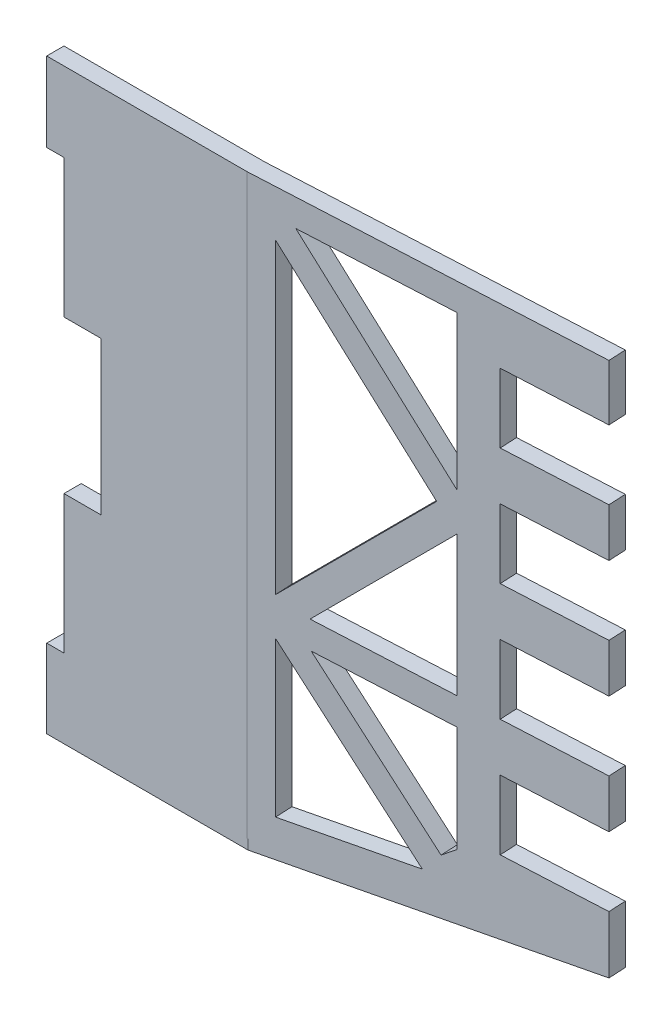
ISO-10303-21;
HEADER;
FILE_DESCRIPTION(('STEP AP214'),'2;1');
FILE_NAME('part.step','',(''),(''),'','','');
FILE_SCHEMA(('AUTOMOTIVE_DESIGN { 1 0 10303 214 1 1 1 1 }'));
ENDSEC;
DATA;
#1=APPLICATION_CONTEXT('core data for automotive mechanical design processes');
#2=APPLICATION_PROTOCOL_DEFINITION('international standard','automotive_design',2000,#1);
#3=PRODUCT_CONTEXT('',#1,'mechanical');
#4=PRODUCT('Part','Part','',(#3));
#5=PRODUCT_RELATED_PRODUCT_CATEGORY('part','',(#4));
#6=PRODUCT_DEFINITION_FORMATION('','',#4);
#7=PRODUCT_DEFINITION_CONTEXT('part definition',#1,'design');
#8=PRODUCT_DEFINITION('design','',#6,#7);
#9=PRODUCT_DEFINITION_SHAPE('','',#8);
#10=(LENGTH_UNIT() NAMED_UNIT(*) SI_UNIT(.MILLI.,.METRE.));
#11=(NAMED_UNIT(*) PLANE_ANGLE_UNIT() SI_UNIT($,.RADIAN.));
#12=(NAMED_UNIT(*) SI_UNIT($,.STERADIAN.) SOLID_ANGLE_UNIT());
#13=UNCERTAINTY_MEASURE_WITH_UNIT(LENGTH_MEASURE(1.E-05),#10,'distance_accuracy_value','');
#14=(GEOMETRIC_REPRESENTATION_CONTEXT(3) GLOBAL_UNCERTAINTY_ASSIGNED_CONTEXT((#13)) GLOBAL_UNIT_ASSIGNED_CONTEXT((#10,
#11,#12)) REPRESENTATION_CONTEXT('',''));
#15=CARTESIAN_POINT('',(0.,0.,0.));
#16=DIRECTION('',(0.,0.,1.));
#17=DIRECTION('',(1.,0.,0.));
#18=AXIS2_PLACEMENT_3D('',#15,#16,#17);
#19=CARTESIAN_POINT('',(0.,106.172,5.));
#20=DIRECTION('',(0.,0.,1.));
#21=DIRECTION('',(-1.,0.,0.));
#22=AXIS2_PLACEMENT_3D('',#19,#20,#21);
#23=PLANE('',#22);
#24=DIRECTION('',(0.,-1.,0.));
#25=VECTOR('',#24,1.);
#26=CARTESIAN_POINT('',(0.,106.172,5.));
#27=LINE('',#26,#25);
#28=CARTESIAN_POINT('',(0.,12.7,5.));
#29=VERTEX_POINT('',#28);
#30=CARTESIAN_POINT('',(0.,-1.745,5.));
#31=VERTEX_POINT('',#30);
#32=EDGE_CURVE('E742',#29,#31,#27,.T.);
#33=ORIENTED_EDGE('',*,*,#32,.T.);
#34=DIRECTION('',(1.,0.,0.));
#35=VECTOR('',#34,1.);
#36=CARTESIAN_POINT('',(0.,-1.745,5.));
#37=LINE('',#36,#35);
#38=CARTESIAN_POINT('',(36.8762781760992,-1.745,5.00000000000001));
#39=VERTEX_POINT('',#38);
#40=EDGE_CURVE('E888',#31,#39,#37,.T.);
#41=ORIENTED_EDGE('',*,*,#40,.T.);
#42=DIRECTION('',(0.,1.,0.));
#43=VECTOR('',#42,1.);
#44=CARTESIAN_POINT('',(36.8762781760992,-1.745,5.));
#45=LINE('',#44,#43);
#46=CARTESIAN_POINT('',(36.8762781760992,0.,5.00000000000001));
#47=VERTEX_POINT('',#46);
#48=EDGE_CURVE('E885',#39,#47,#45,.T.);
#49=ORIENTED_EDGE('',*,*,#48,.T.);
#50=DIRECTION('',(-1.,0.,0.));
#51=VECTOR('',#50,1.);
#52=CARTESIAN_POINT('',(0.,0.,5.));
#53=LINE('',#52,#51);
#54=CARTESIAN_POINT('',(36.83,0.,5.00000000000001));
#55=VERTEX_POINT('',#54);
#56=EDGE_CURVE('E533',#47,#55,#53,.T.);
#57=ORIENTED_EDGE('',*,*,#56,.T.);
#58=DIRECTION('',(0.,-1.,0.));
#59=VECTOR('',#58,1.);
#60=CARTESIAN_POINT('',(36.83,106.172,5.00000000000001));
#61=LINE('',#60,#59);
#62=CARTESIAN_POINT('',(36.83,106.172,5.00000000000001));
#63=VERTEX_POINT('',#62);
#64=EDGE_CURVE('E733',#63,#55,#61,.T.);
#65=ORIENTED_EDGE('',*,*,#64,.F.);
#66=DIRECTION('',(1.,0.,0.));
#67=VECTOR('',#66,1.);
#68=CARTESIAN_POINT('',(0.,106.172,5.));
#69=LINE('',#68,#67);
#70=CARTESIAN_POINT('',(0.,106.172,5.));
#71=VERTEX_POINT('',#70);
#72=EDGE_CURVE('E737',#71,#63,#69,.T.);
#73=ORIENTED_EDGE('',*,*,#72,.F.);
#74=CARTESIAN_POINT('',(0.,91.599999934,5.));
#75=VERTEX_POINT('',#74);
#76=EDGE_CURVE('E738',#71,#75,#27,.T.);
#77=ORIENTED_EDGE('',*,*,#76,.T.);
#78=DIRECTION('',(1.,0.,0.));
#79=VECTOR('',#78,1.);
#80=CARTESIAN_POINT('',(0.,91.599999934,5.));
#81=LINE('',#80,#79);
#82=CARTESIAN_POINT('',(3.1749492,91.599999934,5.));
#83=VERTEX_POINT('',#82);
#84=EDGE_CURVE('E509',#75,#83,#81,.T.);
#85=ORIENTED_EDGE('',*,*,#84,.T.);
#86=DIRECTION('',(0.,-1.,0.));
#87=VECTOR('',#86,1.);
#88=CARTESIAN_POINT('',(3.1749492,106.172,5.));
#89=LINE('',#88,#87);
#90=CARTESIAN_POINT('',(3.1749492,66.199999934,5.));
#91=VERTEX_POINT('',#90);
#92=EDGE_CURVE('E473',#83,#91,#89,.T.);
#93=ORIENTED_EDGE('',*,*,#92,.T.);
#94=DIRECTION('',(1.,0.,0.));
#95=VECTOR('',#94,1.);
#96=CARTESIAN_POINT('',(0.,66.199999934,5.));
#97=LINE('',#96,#95);
#98=CARTESIAN_POINT('',(10.,66.199999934,5.));
#99=VERTEX_POINT('',#98);
#100=EDGE_CURVE('E477',#91,#99,#97,.T.);
#101=ORIENTED_EDGE('',*,*,#100,.T.);
#102=DIRECTION('',(0.,-1.,0.));
#103=VECTOR('',#102,1.);
#104=CARTESIAN_POINT('',(10.,106.172,5.));
#105=LINE('',#104,#103);
#106=CARTESIAN_POINT('',(9.99999999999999,38.1,5.));
#107=VERTEX_POINT('',#106);
#108=EDGE_CURVE('E481',#99,#107,#105,.T.);
#109=ORIENTED_EDGE('',*,*,#108,.T.);
#110=DIRECTION('',(1.,0.,0.));
#111=VECTOR('',#110,1.);
#112=CARTESIAN_POINT('',(0.,38.1,5.));
#113=LINE('',#112,#111);
#114=CARTESIAN_POINT('',(3.17494919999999,38.1,5.));
#115=VERTEX_POINT('',#114);
#116=EDGE_CURVE('E485',#115,#107,#113,.T.);
#117=ORIENTED_EDGE('',*,*,#116,.F.);
#118=DIRECTION('',(0.,1.,0.));
#119=VECTOR('',#118,1.);
#120=CARTESIAN_POINT('',(3.17494919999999,106.172,5.));
#121=LINE('',#120,#119);
#122=CARTESIAN_POINT('',(3.17494919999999,12.7,5.));
#123=VERTEX_POINT('',#122);
#124=EDGE_CURVE('E489',#123,#115,#121,.T.);
#125=ORIENTED_EDGE('',*,*,#124,.F.);
#126=DIRECTION('',(1.,0.,0.));
#127=VECTOR('',#126,1.);
#128=CARTESIAN_POINT('',(0.,12.7,5.));
#129=LINE('',#128,#127);
#130=EDGE_CURVE('E673',#29,#123,#129,.T.);
#131=ORIENTED_EDGE('',*,*,#130,.F.);
#132=EDGE_LOOP('',(#33,#41,#49,#57,#65,#73,#77,#85,#93,#101,#109,#117,#125,#131));
#133=FACE_BOUND('',#132,.T.);
#134=ADVANCED_FACE('F51',(#133),#23,.T.);
#135=CARTESIAN_POINT('',(0.,106.172,0.));
#136=DIRECTION('',(-1.,0.,0.));
#137=DIRECTION('',(0.,0.,-1.));
#138=AXIS2_PLACEMENT_3D('',#135,#136,#137);
#139=PLANE('',#138);
#140=DIRECTION('',(0.,1.,0.));
#141=VECTOR('',#140,1.);
#142=CARTESIAN_POINT('',(0.,0.,1.825));
#143=LINE('',#142,#141);
#144=CARTESIAN_POINT('',(0.,-1.745,1.825));
#145=VERTEX_POINT('',#144);
#146=CARTESIAN_POINT('',(0.,12.7,1.825));
#147=VERTEX_POINT('',#146);
#148=EDGE_CURVE('E517',#145,#147,#143,.T.);
#149=ORIENTED_EDGE('',*,*,#148,.F.);
#150=DIRECTION('',(0.,0.,-1.));
#151=VECTOR('',#150,1.);
#152=CARTESIAN_POINT('',(0.,-1.745,41.9175421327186));
#153=LINE('',#152,#151);
#154=EDGE_CURVE('E528',#31,#145,#153,.T.);
#155=ORIENTED_EDGE('',*,*,#154,.F.);
#156=ORIENTED_EDGE('',*,*,#32,.F.);
#157=DIRECTION('',(0.,0.,1.));
#158=VECTOR('',#157,1.);
#159=CARTESIAN_POINT('',(0.,12.7,0.));
#160=LINE('',#159,#158);
#161=EDGE_CURVE('E470',#147,#29,#160,.T.);
#162=ORIENTED_EDGE('',*,*,#161,.F.);
#163=EDGE_LOOP('',(#149,#155,#156,#162));
#164=FACE_BOUND('',#163,.T.);
#165=ADVANCED_FACE('F905',(#164),#139,.T.);
#166=CARTESIAN_POINT('',(0.34769888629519,106.172,6.85141993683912));
#167=DIRECTION('',(-0.0506832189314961,0.,-0.998714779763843));
#168=DIRECTION('',(0.998714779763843,0.,-0.0506832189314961));
#169=AXIS2_PLACEMENT_3D('',#166,#167,#168);
#170=PLANE('',#169);
#171=DIRECTION('',(0.70619799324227,-0.707106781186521,-0.0358384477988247));
#172=VECTOR('',#171,1.);
#173=CARTESIAN_POINT('',(69.8411272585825,69.5828576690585,3.32473672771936));
#174=LINE('',#173,#172);
#175=CARTESIAN_POINT('',(41.8235738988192,97.6364660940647,4.74658390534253));
#176=VERTEX_POINT('',#175);
#177=CARTESIAN_POINT('',(70.0017781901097,69.422,3.31658394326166));
#178=VERTEX_POINT('',#177);
#179=EDGE_CURVE('E777',#176,#178,#174,.T.);
#180=ORIENTED_EDGE('',*,*,#179,.T.);
#181=DIRECTION('',(0.70619799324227,0.70710678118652,-0.0358384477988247));
#182=VECTOR('',#181,1.);
#183=CARTESIAN_POINT('',(0.508349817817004,-0.160857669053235,6.84326715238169));
#184=LINE('',#183,#182);
#185=CARTESIAN_POINT('',(41.8235738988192,41.2075339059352,4.74658390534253));
#186=VERTEX_POINT('',#185);
#187=EDGE_CURVE('E677',#186,#178,#184,.T.);
#188=ORIENTED_EDGE('',*,*,#187,.F.);
#189=DIRECTION('',(0.,1.,0.));
#190=VECTOR('',#189,1.);
#191=CARTESIAN_POINT('',(41.8235738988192,0.,4.74658390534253));
#192=LINE('',#191,#190);
#193=EDGE_CURVE('E795',#186,#176,#192,.T.);
#194=ORIENTED_EDGE('',*,*,#193,.T.);
#195=EDGE_LOOP('',(#180,#188,#194));
#196=FACE_BOUND('',#195,.T.);
#197=DIRECTION('',(-0.722545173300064,0.690350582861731,0.0366680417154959));
#198=VECTOR('',#197,1.);
#199=CARTESIAN_POINT('',(37.1819267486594,38.6512839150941,4.98214026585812));
#200=LINE('',#199,#198);
#201=CARTESIAN_POINT('',(67.4992342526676,9.68483077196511,3.44358414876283));
#202=VERTEX_POINT('',#201);
#203=CARTESIAN_POINT('',(41.8235738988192,34.2164555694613,4.74658390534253));
#204=VERTEX_POINT('',#203);
#205=EDGE_CURVE('E802',#202,#204,#200,.T.);
#206=ORIENTED_EDGE('',*,*,#205,.F.);
#207=DIRECTION('',(-0.987382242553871,-0.150218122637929,0.0501081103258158));
#208=VECTOR('',#207,1.);
#209=CARTESIAN_POINT('',(0.426525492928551,-0.519460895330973,6.84741960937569));
#210=LINE('',#209,#208);
#211=CARTESIAN_POINT('',(41.8235738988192,5.77859331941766,4.74658390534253));
#212=VERTEX_POINT('',#211);
#213=EDGE_CURVE('E812',#202,#212,#210,.T.);
#214=ORIENTED_EDGE('',*,*,#213,.T.);
#215=DIRECTION('',(0.,1.,0.));
#216=VECTOR('',#215,1.);
#217=CARTESIAN_POINT('',(41.8235738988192,0.,4.74658390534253));
#218=LINE('',#217,#216);
#219=EDGE_CURVE('E813',#212,#204,#218,.T.);
#220=ORIENTED_EDGE('',*,*,#219,.T.);
#221=EDGE_LOOP('',(#206,#214,#220));
#222=FACE_BOUND('',#221,.T.);
#223=DIRECTION('',(0.70619799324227,-0.707106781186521,-0.0358384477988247));
#224=VECTOR('',#223,1.);
#225=CARTESIAN_POINT('',(73.3721172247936,73.1183915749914,3.14554448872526));
#226=LINE('',#225,#224);
#227=CARTESIAN_POINT('',(45.3545638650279,101.172,4.56739166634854));
#228=VERTEX_POINT('',#227);
#229=CARTESIAN_POINT('',(73.532768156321,72.9575339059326,3.13739170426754));
#230=VERTEX_POINT('',#229);
#231=EDGE_CURVE('E768',#228,#230,#226,.T.);
#232=ORIENTED_EDGE('',*,*,#231,.F.);
#233=DIRECTION('',(0.998714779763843,0.,-0.0506832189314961));
#234=VECTOR('',#233,1.);
#235=CARTESIAN_POINT('',(0.34769888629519,101.172,6.85141993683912));
#236=LINE('',#235,#234);
#237=CARTESIAN_POINT('',(73.532768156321,101.172,3.13739170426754));
#238=VERTEX_POINT('',#237);
#239=EDGE_CURVE('E781',#228,#238,#236,.T.);
#240=ORIENTED_EDGE('',*,*,#239,.T.);
#241=DIRECTION('',(0.,-1.,0.));
#242=VECTOR('',#241,1.);
#243=CARTESIAN_POINT('',(73.5327681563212,1.61931523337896E-13,3.13739170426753));
#244=LINE('',#243,#242);
#245=EDGE_CURVE('E760',#238,#230,#244,.T.);
#246=ORIENTED_EDGE('',*,*,#245,.T.);
#247=EDGE_LOOP('',(#232,#240,#246));
#248=FACE_BOUND('',#247,.T.);
#249=DIRECTION('',(0.998714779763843,0.,-0.0506832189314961));
#250=VECTOR('',#249,1.);
#251=CARTESIAN_POINT('',(0.34769888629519,40.172,6.85141993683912));
#252=LINE('',#251,#250);
#253=CARTESIAN_POINT('',(47.8513508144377,40.172,4.44068361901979));
#254=VERTEX_POINT('',#253);
#255=CARTESIAN_POINT('',(73.5327681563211,40.172,3.13739170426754));
#256=VERTEX_POINT('',#255);
#257=EDGE_CURVE('E698',#254,#256,#252,.T.);
#258=ORIENTED_EDGE('',*,*,#257,.F.);
#259=DIRECTION('',(0.70619799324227,0.70710678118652,-0.0358384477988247));
#260=VECTOR('',#259,1.);
#261=CARTESIAN_POINT('',(4.03933978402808,-3.69639157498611,6.66407491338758));
#262=LINE('',#261,#260);
#263=CARTESIAN_POINT('',(73.5327681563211,65.8864660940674,3.13739170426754));
#264=VERTEX_POINT('',#263);
#265=EDGE_CURVE('E756',#254,#264,#262,.T.);
#266=ORIENTED_EDGE('',*,*,#265,.T.);
#267=EDGE_CURVE('E460',#264,#256,#244,.T.);
#268=ORIENTED_EDGE('',*,*,#267,.T.);
#269=EDGE_LOOP('',(#258,#266,#268));
#270=FACE_BOUND('',#269,.T.);
#271=DIRECTION('',(-0.782296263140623,-0.62164012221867,0.0397003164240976));
#272=VECTOR('',#271,1.);
#273=CARTESIAN_POINT('',(21.0104141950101,-26.0697374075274,5.80281933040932));
#274=LINE('',#273,#272);
#275=CARTESIAN_POINT('',(73.5327681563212,15.6663721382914,3.13739170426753));
#276=VERTEX_POINT('',#275);
#277=CARTESIAN_POINT('',(70.7699489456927,13.470938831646,3.27760047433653));
#278=VERTEX_POINT('',#277);
#279=EDGE_CURVE('E772',#276,#278,#274,.T.);
#280=ORIENTED_EDGE('',*,*,#279,.T.);
#281=DIRECTION('',(-0.722545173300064,0.69035058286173,0.0366680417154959));
#282=VECTOR('',#281,1.);
#283=CARTESIAN_POINT('',(40.6292434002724,42.2686589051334,4.80719431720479));
#284=LINE('',#283,#282);
#285=CARTESIAN_POINT('',(48.0568559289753,35.172,4.43025455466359));
#286=VERTEX_POINT('',#285);
#287=EDGE_CURVE('E776',#278,#286,#284,.T.);
#288=ORIENTED_EDGE('',*,*,#287,.T.);
#289=DIRECTION('',(0.998714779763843,0.,-0.0506832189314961));
#290=VECTOR('',#289,1.);
#291=CARTESIAN_POINT('',(0.34769888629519,35.172,6.85141993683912));
#292=LINE('',#291,#290);
#293=CARTESIAN_POINT('',(73.5327681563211,35.172,3.13739170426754));
#294=VERTEX_POINT('',#293);
#295=EDGE_CURVE('E750',#286,#294,#292,.T.);
#296=ORIENTED_EDGE('',*,*,#295,.T.);
#297=EDGE_CURVE('E825',#294,#276,#244,.T.);
#298=ORIENTED_EDGE('',*,*,#297,.T.);
#299=EDGE_LOOP('',(#280,#288,#296,#298));
#300=FACE_BOUND('',#299,.T.);
#301=DIRECTION('',(0.,1.,0.));
#302=VECTOR('',#301,1.);
#303=CARTESIAN_POINT('',(100.148517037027,106.172,1.78668391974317));
#304=LINE('',#303,#302);
#305=CARTESIAN_POINT('',(100.148517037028,95.8946915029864,1.78668391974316));
#306=VERTEX_POINT('',#305);
#307=CARTESIAN_POINT('',(100.148517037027,106.172,1.78668391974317));
#308=VERTEX_POINT('',#307);
#309=EDGE_CURVE('E407',#306,#308,#304,.T.);
#310=ORIENTED_EDGE('',*,*,#309,.T.);
#311=DIRECTION('',(-0.998714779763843,0.,0.0506832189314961));
#312=VECTOR('',#311,1.);
#313=CARTESIAN_POINT('',(0.34769888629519,106.172,6.85141993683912));
#314=LINE('',#313,#312);
#315=EDGE_CURVE('E465',#308,#63,#314,.T.);
#316=ORIENTED_EDGE('',*,*,#315,.T.);
#317=ORIENTED_EDGE('',*,*,#64,.T.);
#318=DIRECTION('',(-0.998714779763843,0.,0.0506832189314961));
#319=VECTOR('',#318,1.);
#320=CARTESIAN_POINT('',(0.34769888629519,0.,6.85141993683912));
#321=LINE('',#320,#319);
#322=CARTESIAN_POINT('',(37.0830903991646,0.,4.98715605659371));
#323=VERTEX_POINT('',#322);
#324=EDGE_CURVE('E466',#323,#55,#321,.T.);
#325=ORIENTED_EDGE('',*,*,#324,.F.);
#326=DIRECTION('',(0.,1.,0.));
#327=VECTOR('',#326,1.);
#328=CARTESIAN_POINT('',(37.0830903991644,-4.92906907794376,4.98715605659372));
#329=LINE('',#328,#327);
#330=CARTESIAN_POINT('',(37.0830903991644,-1.745,4.98715605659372));
#331=VERTEX_POINT('',#330);
#332=EDGE_CURVE('E861',#331,#323,#329,.T.);
#333=ORIENTED_EDGE('',*,*,#332,.F.);
#334=DIRECTION('',(0.987382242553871,0.15021812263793,-0.0501081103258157));
#335=VECTOR('',#334,1.);
#336=CARTESIAN_POINT('',(100.148517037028,7.84963274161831,1.78668391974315));
#337=LINE('',#336,#335);
#338=CARTESIAN_POINT('',(100.148517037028,7.84963274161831,1.78668391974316));
#339=VERTEX_POINT('',#338);
#340=EDGE_CURVE('E381',#331,#339,#337,.T.);
#341=ORIENTED_EDGE('',*,*,#340,.T.);
#342=DIRECTION('',(0.,1.,0.));
#343=VECTOR('',#342,1.);
#344=CARTESIAN_POINT('',(100.148517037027,106.172,1.78668391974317));
#345=LINE('',#344,#343);
#346=CARTESIAN_POINT('',(100.148517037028,18.4246915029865,1.78668391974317));
#347=VERTEX_POINT('',#346);
#348=EDGE_CURVE('E378',#339,#347,#345,.T.);
#349=ORIENTED_EDGE('',*,*,#348,.T.);
#350=DIRECTION('',(0.998714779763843,0.,-0.0506832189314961));
#351=VECTOR('',#350,1.);
#352=CARTESIAN_POINT('',(0.347698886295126,18.4246915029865,6.85141993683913));
#353=LINE('',#352,#351);
#354=CARTESIAN_POINT('',(81.1230004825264,18.4246915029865,2.75219924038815));
#355=VERTEX_POINT('',#354);
#356=EDGE_CURVE('E399',#355,#347,#353,.T.);
#357=ORIENTED_EDGE('',*,*,#356,.F.);
#358=DIRECTION('',(0.,-1.,0.));
#359=VECTOR('',#358,1.);
#360=CARTESIAN_POINT('',(81.1230004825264,106.172,2.75219924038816));
#361=LINE('',#360,#359);
#362=CARTESIAN_POINT('',(81.1230004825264,31.1246915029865,2.75219924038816));
#363=VERTEX_POINT('',#362);
#364=EDGE_CURVE('E722',#363,#355,#361,.T.);
#365=ORIENTED_EDGE('',*,*,#364,.F.);
#366=DIRECTION('',(-0.998714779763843,0.,0.0506832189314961));
#367=VECTOR('',#366,1.);
#368=CARTESIAN_POINT('',(0.347698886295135,31.1246915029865,6.85141993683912));
#369=LINE('',#368,#367);
#370=CARTESIAN_POINT('',(100.148517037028,31.1246915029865,1.78668391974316));
#371=VERTEX_POINT('',#370);
#372=EDGE_CURVE('E715',#371,#363,#369,.T.);
#373=ORIENTED_EDGE('',*,*,#372,.F.);
#374=DIRECTION('',(0.,1.,0.));
#375=VECTOR('',#374,1.);
#376=CARTESIAN_POINT('',(100.148517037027,106.172,1.78668391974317));
#377=LINE('',#376,#375);
#378=CARTESIAN_POINT('',(100.148517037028,40.0146915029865,1.78668391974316));
#379=VERTEX_POINT('',#378);
#380=EDGE_CURVE('E416',#371,#379,#377,.T.);
#381=ORIENTED_EDGE('',*,*,#380,.T.);
#382=DIRECTION('',(0.998714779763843,0.,-0.0506832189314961));
#383=VECTOR('',#382,1.);
#384=CARTESIAN_POINT('',(0.347698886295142,40.0146915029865,6.85141993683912));
#385=LINE('',#384,#383);
#386=CARTESIAN_POINT('',(81.1230004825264,40.0146915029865,2.75219924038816));
#387=VERTEX_POINT('',#386);
#388=EDGE_CURVE('E702',#387,#379,#385,.T.);
#389=ORIENTED_EDGE('',*,*,#388,.F.);
#390=DIRECTION('',(0.,1.,0.));
#391=VECTOR('',#390,1.);
#392=CARTESIAN_POINT('',(81.1230004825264,106.172,2.75219924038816));
#393=LINE('',#392,#391);
#394=CARTESIAN_POINT('',(81.1230004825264,52.7146915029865,2.75219924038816));
#395=VERTEX_POINT('',#394);
#396=EDGE_CURVE('E423',#387,#395,#393,.T.);
#397=ORIENTED_EDGE('',*,*,#396,.T.);
#398=DIRECTION('',(0.998714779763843,0.,-0.0506832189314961));
#399=VECTOR('',#398,1.);
#400=CARTESIAN_POINT('',(0.34769888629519,52.7146915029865,6.85141993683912));
#401=LINE('',#400,#399);
#402=CARTESIAN_POINT('',(100.148517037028,52.7146915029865,1.78668391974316));
#403=VERTEX_POINT('',#402);
#404=EDGE_CURVE('E427',#395,#403,#401,.T.);
#405=ORIENTED_EDGE('',*,*,#404,.T.);
#406=DIRECTION('',(0.,1.,0.));
#407=VECTOR('',#406,1.);
#408=CARTESIAN_POINT('',(100.148517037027,106.172,1.78668391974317));
#409=LINE('',#408,#407);
#410=CARTESIAN_POINT('',(100.148517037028,61.6046915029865,1.78668391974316));
#411=VERTEX_POINT('',#410);
#412=EDGE_CURVE('E431',#403,#411,#409,.T.);
#413=ORIENTED_EDGE('',*,*,#412,.T.);
#414=DIRECTION('',(0.998714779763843,0.,-0.0506832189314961));
#415=VECTOR('',#414,1.);
#416=CARTESIAN_POINT('',(0.34769888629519,61.6046915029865,6.85141993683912));
#417=LINE('',#416,#415);
#418=CARTESIAN_POINT('',(81.1230004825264,61.6046915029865,2.75219924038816));
#419=VERTEX_POINT('',#418);
#420=EDGE_CURVE('E697',#419,#411,#417,.T.);
#421=ORIENTED_EDGE('',*,*,#420,.F.);
#422=DIRECTION('',(0.,-1.,0.));
#423=VECTOR('',#422,1.);
#424=CARTESIAN_POINT('',(81.1230004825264,106.172,2.75219924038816));
#425=LINE('',#424,#423);
#426=CARTESIAN_POINT('',(81.1230004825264,74.3046915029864,2.75219924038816));
#427=VERTEX_POINT('',#426);
#428=EDGE_CURVE('E693',#427,#419,#425,.T.);
#429=ORIENTED_EDGE('',*,*,#428,.F.);
#430=DIRECTION('',(0.998714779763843,0.,-0.0506832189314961));
#431=VECTOR('',#430,1.);
#432=CARTESIAN_POINT('',(0.347698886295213,74.3046915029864,6.85141993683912));
#433=LINE('',#432,#431);
#434=CARTESIAN_POINT('',(100.148517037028,74.3046915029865,1.78668391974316));
#435=VERTEX_POINT('',#434);
#436=EDGE_CURVE('E441',#427,#435,#433,.T.);
#437=ORIENTED_EDGE('',*,*,#436,.T.);
#438=DIRECTION('',(0.,1.,0.));
#439=VECTOR('',#438,1.);
#440=CARTESIAN_POINT('',(100.148517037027,106.172,1.78668391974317));
#441=LINE('',#440,#439);
#442=CARTESIAN_POINT('',(100.148517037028,83.1946915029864,1.78668391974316));
#443=VERTEX_POINT('',#442);
#444=EDGE_CURVE('E445',#435,#443,#441,.T.);
#445=ORIENTED_EDGE('',*,*,#444,.T.);
#446=DIRECTION('',(-0.998714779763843,0.,0.0506832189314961));
#447=VECTOR('',#446,1.);
#448=CARTESIAN_POINT('',(0.347698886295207,83.1946915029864,6.85141993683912));
#449=LINE('',#448,#447);
#450=CARTESIAN_POINT('',(81.1230004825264,83.1946915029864,2.75219924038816));
#451=VERTEX_POINT('',#450);
#452=EDGE_CURVE('E449',#443,#451,#449,.T.);
#453=ORIENTED_EDGE('',*,*,#452,.T.);
#454=DIRECTION('',(0.,1.,0.));
#455=VECTOR('',#454,1.);
#456=CARTESIAN_POINT('',(81.1230004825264,106.172,2.75219924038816));
#457=LINE('',#456,#455);
#458=CARTESIAN_POINT('',(81.1230004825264,95.8946915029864,2.75219924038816));
#459=VERTEX_POINT('',#458);
#460=EDGE_CURVE('E453',#451,#459,#457,.T.);
#461=ORIENTED_EDGE('',*,*,#460,.T.);
#462=DIRECTION('',(0.998714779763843,0.,-0.0506832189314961));
#463=VECTOR('',#462,1.);
#464=CARTESIAN_POINT('',(0.347698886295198,95.8946915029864,6.85141993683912));
#465=LINE('',#464,#463);
#466=EDGE_CURVE('E457',#459,#306,#465,.T.);
#467=ORIENTED_EDGE('',*,*,#466,.T.);
#468=EDGE_LOOP('',(#310,#316,#317,#325,#333,#341,#349,#357,#365,#373,#381,#389,#397,#405,#413,
#421,#429,#437,#445,#453,#461,#467));
#469=FACE_BOUND('',#468,.T.);
#470=ADVANCED_FACE('F856',(#196,#222,#248,#270,#300,#469),#170,.F.);
#471=CARTESIAN_POINT('',(0.,106.172,0.));
#472=DIRECTION('',(0.,1.,0.));
#473=DIRECTION('',(0.,0.,-1.));
#474=AXIS2_PLACEMENT_3D('',#471,#472,#473);
#475=PLANE('',#474);
#476=DIRECTION('',(-1.,0.,0.));
#477=VECTOR('',#476,1.);
#478=CARTESIAN_POINT('',(0.,106.172,1.825));
#479=LINE('',#478,#477);
#480=CARTESIAN_POINT('',(36.8762781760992,106.172,1.825));
#481=VERTEX_POINT('',#480);
#482=CARTESIAN_POINT('',(0.,106.172,1.825));
#483=VERTEX_POINT('',#482);
#484=EDGE_CURVE('E393',#481,#483,#479,.T.);
#485=ORIENTED_EDGE('',*,*,#484,.T.);
#486=DIRECTION('',(0.,0.,1.));
#487=VECTOR('',#486,1.);
#488=CARTESIAN_POINT('',(0.,106.172,0.));
#489=LINE('',#488,#487);
#490=EDGE_CURVE('E514',#483,#71,#489,.T.);
#491=ORIENTED_EDGE('',*,*,#490,.T.);
#492=ORIENTED_EDGE('',*,*,#72,.T.);
#493=ORIENTED_EDGE('',*,*,#315,.F.);
#494=DIRECTION('',(0.0506832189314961,0.,0.998714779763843));
#495=VECTOR('',#494,1.);
#496=CARTESIAN_POINT('',(98.3541534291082,106.172,-33.571320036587));
#497=LINE('',#496,#495);
#498=CARTESIAN_POINT('',(99.9879235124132,106.172,-1.37781766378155));
#499=VERTEX_POINT('',#498);
#500=EDGE_CURVE('E462',#499,#308,#497,.T.);
#501=ORIENTED_EDGE('',*,*,#500,.F.);
#502=DIRECTION('',(-0.998714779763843,0.,0.0506832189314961));
#503=VECTOR('',#502,1.);
#504=CARTESIAN_POINT('',(0.187105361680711,106.172,3.68691835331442));
#505=LINE('',#504,#503);
#506=EDGE_CURVE('E647',#499,#481,#505,.T.);
#507=ORIENTED_EDGE('',*,*,#506,.T.);
#508=EDGE_LOOP('',(#485,#491,#492,#493,#501,#507));
#509=FACE_BOUND('',#508,.T.);
#510=ADVANCED_FACE('F919',(#509),#475,.T.);
#511=CARTESIAN_POINT('',(-1.44666472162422,40.172,-28.5065840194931));
#512=DIRECTION('',(0.,1.,0.));
#513=DIRECTION('',(0.,0.,-1.));
#514=AXIS2_PLACEMENT_3D('',#511,#512,#513);
#515=PLANE('',#514);
#516=DIRECTION('',(-0.998714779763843,0.,0.0506832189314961));
#517=VECTOR('',#516,1.);
#518=CARTESIAN_POINT('',(0.187105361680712,40.172,3.68691835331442));
#519=LINE('',#518,#517);
#520=CARTESIAN_POINT('',(73.3721746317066,40.172,-0.0271098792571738));
#521=VERTEX_POINT('',#520);
#522=CARTESIAN_POINT('',(47.6907572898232,40.172,1.27618203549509));
#523=VERTEX_POINT('',#522);
#524=EDGE_CURVE('E602',#521,#523,#519,.T.);
#525=ORIENTED_EDGE('',*,*,#524,.T.);
#526=DIRECTION('',(0.0506832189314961,0.,0.998714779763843));
#527=VECTOR('',#526,1.);
#528=CARTESIAN_POINT('',(46.0569872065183,40.172,-30.9173203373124));
#529=LINE('',#528,#527);
#530=EDGE_CURVE('E741',#523,#254,#529,.T.);
#531=ORIENTED_EDGE('',*,*,#530,.T.);
#532=ORIENTED_EDGE('',*,*,#257,.T.);
#533=DIRECTION('',(0.0506832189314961,0.,0.998714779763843));
#534=VECTOR('',#533,1.);
#535=CARTESIAN_POINT('',(71.7384045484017,40.172,-32.2206122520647));
#536=LINE('',#535,#534);
#537=EDGE_CURVE('E753',#521,#256,#536,.T.);
#538=ORIENTED_EDGE('',*,*,#537,.F.);
#539=EDGE_LOOP('',(#525,#531,#532,#538));
#540=FACE_BOUND('',#539,.T.);
#541=ADVANCED_FACE('F1071',(#540),#515,.T.);
#542=CARTESIAN_POINT('',(-1.44666472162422,101.172,-28.5065840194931));
#543=DIRECTION('',(0.,1.,0.));
#544=DIRECTION('',(0.,0.,-1.));
#545=AXIS2_PLACEMENT_3D('',#542,#543,#544);
#546=PLANE('',#545);
#547=DIRECTION('',(0.0506832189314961,0.,0.998714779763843));
#548=VECTOR('',#547,1.);
#549=CARTESIAN_POINT('',(71.7384045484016,101.172,-32.2206122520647));
#550=LINE('',#549,#548);
#551=CARTESIAN_POINT('',(73.3721746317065,101.172,-0.0271098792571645));
#552=VERTEX_POINT('',#551);
#553=EDGE_CURVE('E731',#552,#238,#550,.T.);
#554=ORIENTED_EDGE('',*,*,#553,.T.);
#555=ORIENTED_EDGE('',*,*,#239,.F.);
#556=DIRECTION('',(0.0506832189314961,0.,0.998714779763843));
#557=VECTOR('',#556,1.);
#558=CARTESIAN_POINT('',(43.5602002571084,101.172,-30.7906122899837));
#559=LINE('',#558,#557);
#560=CARTESIAN_POINT('',(45.1939703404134,101.172,1.40289008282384));
#561=VERTEX_POINT('',#560);
#562=EDGE_CURVE('E829',#561,#228,#559,.T.);
#563=ORIENTED_EDGE('',*,*,#562,.F.);
#564=DIRECTION('',(-0.998714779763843,0.,0.0506832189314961));
#565=VECTOR('',#564,1.);
#566=CARTESIAN_POINT('',(0.187105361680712,101.172,3.68691835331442));
#567=LINE('',#566,#565);
#568=EDGE_CURVE('E612',#552,#561,#567,.T.);
#569=ORIENTED_EDGE('',*,*,#568,.F.);
#570=EDGE_LOOP('',(#554,#555,#563,#569));
#571=FACE_BOUND('',#570,.T.);
#572=ADVANCED_FACE('F1121',(#571),#546,.F.);
#573=CARTESIAN_POINT('',(19.2160505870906,-26.0697374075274,-29.5551846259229));
#574=DIRECTION('',(0.620841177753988,-0.783302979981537,-0.0315067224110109));
#575=DIRECTION('',(0.783692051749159,0.621149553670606,0.));
#576=AXIS2_PLACEMENT_3D('',#573,#574,#575);
#577=PLANE('',#576);
#578=DIRECTION('',(0.0506832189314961,0.,0.998714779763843));
#579=VECTOR('',#578,1.);
#580=CARTESIAN_POINT('',(68.9755853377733,13.470938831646,-32.0804034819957));
#581=LINE('',#580,#579);
#582=CARTESIAN_POINT('',(70.6093554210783,13.470938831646,0.11309889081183));
#583=VERTEX_POINT('',#582);
#584=EDGE_CURVE('E773',#583,#278,#581,.T.);
#585=ORIENTED_EDGE('',*,*,#584,.T.);
#586=ORIENTED_EDGE('',*,*,#279,.F.);
#587=DIRECTION('',(-0.0506832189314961,0.,-0.998714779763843));
#588=VECTOR('',#587,1.);
#589=CARTESIAN_POINT('',(71.7384045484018,15.6663721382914,-32.2206122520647));
#590=LINE('',#589,#588);
#591=CARTESIAN_POINT('',(73.3721746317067,15.6663721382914,-0.0271098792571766));
#592=VERTEX_POINT('',#591);
#593=EDGE_CURVE('E732',#276,#592,#590,.T.);
#594=ORIENTED_EDGE('',*,*,#593,.T.);
#595=DIRECTION('',(0.782296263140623,0.62164012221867,-0.0397003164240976));
#596=VECTOR('',#595,1.);
#597=CARTESIAN_POINT('',(20.8498206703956,-26.0697374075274,2.63831774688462));
#598=LINE('',#597,#596);
#599=EDGE_CURVE('E623',#583,#592,#598,.T.);
#600=ORIENTED_EDGE('',*,*,#599,.F.);
#601=EDGE_LOOP('',(#585,#586,#594,#600));
#602=FACE_BOUND('',#601,.T.);
#603=ADVANCED_FACE('F1098',(#602),#577,.F.);
#604=CARTESIAN_POINT('',(-1.44666472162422,35.172,-28.5065840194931));
#605=DIRECTION('',(0.,1.,0.));
#606=DIRECTION('',(0.,0.,-1.));
#607=AXIS2_PLACEMENT_3D('',#604,#605,#606);
#608=PLANE('',#607);
#609=DIRECTION('',(0.0506832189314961,0.,0.998714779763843));
#610=VECTOR('',#609,1.);
#611=CARTESIAN_POINT('',(71.7384045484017,35.172,-32.2206122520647));
#612=LINE('',#611,#610);
#613=CARTESIAN_POINT('',(73.3721746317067,35.172,-0.0271098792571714));
#614=VERTEX_POINT('',#613);
#615=EDGE_CURVE('E728',#614,#294,#612,.T.);
#616=ORIENTED_EDGE('',*,*,#615,.T.);
#617=ORIENTED_EDGE('',*,*,#295,.F.);
#618=DIRECTION('',(0.0506832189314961,0.,0.998714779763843));
#619=VECTOR('',#618,1.);
#620=CARTESIAN_POINT('',(46.2624923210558,35.172,-30.9277494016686));
#621=LINE('',#620,#619);
#622=CARTESIAN_POINT('',(47.8962624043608,35.172,1.26575297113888));
#623=VERTEX_POINT('',#622);
#624=EDGE_CURVE('E769',#623,#286,#621,.T.);
#625=ORIENTED_EDGE('',*,*,#624,.F.);
#626=DIRECTION('',(-0.998714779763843,0.,0.0506832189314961));
#627=VECTOR('',#626,1.);
#628=CARTESIAN_POINT('',(0.187105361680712,35.172,3.68691835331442));
#629=LINE('',#628,#627);
#630=EDGE_CURVE('E619',#614,#623,#629,.T.);
#631=ORIENTED_EDGE('',*,*,#630,.F.);
#632=EDGE_LOOP('',(#616,#617,#625,#631));
#633=FACE_BOUND('',#632,.T.);
#634=ADVANCED_FACE('F1091',(#633),#608,.F.);
#635=CARTESIAN_POINT('',(0.,91.599999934,1.825));
#636=VERTEX_POINT('',#635);
#637=EDGE_CURVE('E500',#636,#483,#143,.T.);
#638=ORIENTED_EDGE('',*,*,#637,.F.);
#639=DIRECTION('',(0.,0.,1.));
#640=VECTOR('',#639,1.);
#641=CARTESIAN_POINT('',(0.,91.599999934,0.));
#642=LINE('',#641,#640);
#643=EDGE_CURVE('E467',#636,#75,#642,.T.);
#644=ORIENTED_EDGE('',*,*,#643,.T.);
#645=ORIENTED_EDGE('',*,*,#76,.F.);
#646=ORIENTED_EDGE('',*,*,#490,.F.);
#647=EDGE_LOOP('',(#638,#644,#645,#646));
#648=FACE_BOUND('',#647,.T.);
#649=ADVANCED_FACE('F513',(#648),#139,.T.);
#650=CARTESIAN_POINT('',(2.24497617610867,-3.69639157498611,-28.6939290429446));
#651=DIRECTION('',(-0.706197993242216,0.707106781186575,0.0358384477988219));
#652=DIRECTION('',(-0.707561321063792,-0.706651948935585,0.));
#653=AXIS2_PLACEMENT_3D('',#650,#651,#652);
#654=PLANE('',#653);
#655=DIRECTION('',(0.0506832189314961,0.,0.998714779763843));
#656=VECTOR('',#655,1.);
#657=CARTESIAN_POINT('',(71.7384045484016,65.8864660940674,-32.2206122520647));
#658=LINE('',#657,#656);
#659=CARTESIAN_POINT('',(73.3721746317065,65.8864660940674,-0.0271098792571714));
#660=VERTEX_POINT('',#659);
#661=EDGE_CURVE('E757',#660,#264,#658,.T.);
#662=ORIENTED_EDGE('',*,*,#661,.T.);
#663=ORIENTED_EDGE('',*,*,#265,.F.);
#664=ORIENTED_EDGE('',*,*,#530,.F.);
#665=DIRECTION('',(-0.70619799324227,-0.70710678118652,0.0358384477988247));
#666=VECTOR('',#665,1.);
#667=CARTESIAN_POINT('',(3.87874625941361,-3.69639157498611,3.49957332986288));
#668=LINE('',#667,#666);
#669=EDGE_CURVE('E599',#660,#523,#668,.T.);
#670=ORIENTED_EDGE('',*,*,#669,.F.);
#671=EDGE_LOOP('',(#662,#663,#664,#670));
#672=FACE_BOUND('',#671,.T.);
#673=ADVANCED_FACE('F1076',(#672),#654,.F.);
#674=CARTESIAN_POINT('',(71.5777536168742,73.1183915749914,-32.212459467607));
#675=DIRECTION('',(0.706197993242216,0.707106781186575,-0.0358384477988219));
#676=DIRECTION('',(-0.707561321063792,0.706651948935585,0.));
#677=AXIS2_PLACEMENT_3D('',#674,#675,#676);
#678=PLANE('',#677);
#679=DIRECTION('',(-0.70619799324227,0.707106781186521,0.0358384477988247));
#680=VECTOR('',#679,1.);
#681=CARTESIAN_POINT('',(73.2115237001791,73.1183915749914,-0.0189570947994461));
#682=LINE('',#681,#680);
#683=CARTESIAN_POINT('',(73.3721746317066,72.9575339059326,-0.0271098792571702));
#684=VERTEX_POINT('',#683);
#685=EDGE_CURVE('E609',#684,#561,#682,.T.);
#686=ORIENTED_EDGE('',*,*,#685,.T.);
#687=ORIENTED_EDGE('',*,*,#562,.T.);
#688=ORIENTED_EDGE('',*,*,#231,.T.);
#689=DIRECTION('',(0.0506832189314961,0.,0.998714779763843));
#690=VECTOR('',#689,1.);
#691=CARTESIAN_POINT('',(71.7384045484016,72.9575339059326,-32.2206122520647));
#692=LINE('',#691,#690);
#693=EDGE_CURVE('E764',#684,#230,#692,.T.);
#694=ORIENTED_EDGE('',*,*,#693,.F.);
#695=EDGE_LOOP('',(#686,#687,#688,#694));
#696=FACE_BOUND('',#695,.T.);
#697=ADVANCED_FACE('F1124',(#696),#678,.T.);
#698=CARTESIAN_POINT('',(40.0292102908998,0.,-30.6114200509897));
#699=DIRECTION('',(-0.998714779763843,0.,0.0506832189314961));
#700=DIRECTION('',(-0.0506832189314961,0.,-0.998714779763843));
#701=AXIS2_PLACEMENT_3D('',#698,#699,#700);
#702=PLANE('',#701);
#703=DIRECTION('',(0.0506832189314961,0.,0.998714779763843));
#704=VECTOR('',#703,1.);
#705=CARTESIAN_POINT('',(40.0292102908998,97.6364660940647,-30.6114200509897));
#706=LINE('',#705,#704);
#707=CARTESIAN_POINT('',(41.6629803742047,97.6364660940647,1.58208232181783));
#708=VERTEX_POINT('',#707);
#709=EDGE_CURVE('E789',#708,#176,#706,.T.);
#710=ORIENTED_EDGE('',*,*,#709,.T.);
#711=ORIENTED_EDGE('',*,*,#193,.F.);
#712=DIRECTION('',(0.0506832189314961,0.,0.998714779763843));
#713=VECTOR('',#712,1.);
#714=CARTESIAN_POINT('',(40.0292102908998,41.2075339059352,-30.6114200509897));
#715=LINE('',#714,#713);
#716=CARTESIAN_POINT('',(41.6629803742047,41.2075339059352,1.58208232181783));
#717=VERTEX_POINT('',#716);
#718=EDGE_CURVE('E796',#717,#186,#715,.T.);
#719=ORIENTED_EDGE('',*,*,#718,.F.);
#720=DIRECTION('',(0.,-1.,0.));
#721=VECTOR('',#720,1.);
#722=CARTESIAN_POINT('',(41.6629803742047,0.,1.58208232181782));
#723=LINE('',#722,#721);
#724=EDGE_CURVE('E644',#708,#717,#723,.T.);
#725=ORIENTED_EDGE('',*,*,#724,.F.);
#726=EDGE_LOOP('',(#710,#711,#719,#725));
#727=FACE_BOUND('',#726,.T.);
#728=ADVANCED_FACE('F1133',(#727),#702,.F.);
#729=CARTESIAN_POINT('',(-1.28601379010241,-0.160857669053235,-28.5147368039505));
#730=DIRECTION('',(-0.706197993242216,0.707106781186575,0.0358384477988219));
#731=DIRECTION('',(-0.707561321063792,-0.706651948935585,0.));
#732=AXIS2_PLACEMENT_3D('',#729,#730,#731);
#733=PLANE('',#732);
#734=DIRECTION('',(-0.70619799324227,-0.70710678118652,0.0358384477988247));
#735=VECTOR('',#734,1.);
#736=CARTESIAN_POINT('',(0.347756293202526,-0.160857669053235,3.67876556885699));
#737=LINE('',#736,#735);
#738=CARTESIAN_POINT('',(69.8411846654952,69.422,0.152082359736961));
#739=VERTEX_POINT('',#738);
#740=EDGE_CURVE('E641',#739,#717,#737,.T.);
#741=ORIENTED_EDGE('',*,*,#740,.T.);
#742=ORIENTED_EDGE('',*,*,#718,.T.);
#743=ORIENTED_EDGE('',*,*,#187,.T.);
#744=DIRECTION('',(0.0506832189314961,0.,0.998714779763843));
#745=VECTOR('',#744,1.);
#746=CARTESIAN_POINT('',(68.2074145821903,69.422,-32.0414200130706));
#747=LINE('',#746,#745);
#748=EDGE_CURVE('E792',#739,#178,#747,.T.);
#749=ORIENTED_EDGE('',*,*,#748,.F.);
#750=EDGE_LOOP('',(#741,#742,#743,#749));
#751=FACE_BOUND('',#750,.T.);
#752=ADVANCED_FACE('F1136',(#751),#733,.T.);
#753=CARTESIAN_POINT('',(68.0467636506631,69.5828576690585,-32.0332672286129));
#754=DIRECTION('',(0.706197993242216,0.707106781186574,-0.0358384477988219));
#755=DIRECTION('',(-0.707561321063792,0.706651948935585,0.));
#756=AXIS2_PLACEMENT_3D('',#753,#754,#755);
#757=PLANE('',#756);
#758=ORIENTED_EDGE('',*,*,#748,.T.);
#759=ORIENTED_EDGE('',*,*,#179,.F.);
#760=ORIENTED_EDGE('',*,*,#709,.F.);
#761=DIRECTION('',(-0.70619799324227,0.707106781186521,0.0358384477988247));
#762=VECTOR('',#761,1.);
#763=CARTESIAN_POINT('',(69.6805337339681,69.5828576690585,0.160235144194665));
#764=LINE('',#763,#762);
#765=EDGE_CURVE('E67',#739,#708,#764,.T.);
#766=ORIENTED_EDGE('',*,*,#765,.F.);
#767=EDGE_LOOP('',(#758,#759,#760,#766));
#768=FACE_BOUND('',#767,.T.);
#769=ADVANCED_FACE('F1128',(#768),#757,.F.);
#770=CARTESIAN_POINT('',(38.834879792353,42.2686589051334,-30.5508096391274));
#771=DIRECTION('',(-0.689463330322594,-0.723474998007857,0.034989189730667));
#772=DIRECTION('',(0.723918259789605,-0.68988575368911,0.));
#773=AXIS2_PLACEMENT_3D('',#770,#771,#772);
#774=PLANE('',#773);
#775=ORIENTED_EDGE('',*,*,#624,.T.);
#776=ORIENTED_EDGE('',*,*,#287,.F.);
#777=ORIENTED_EDGE('',*,*,#584,.F.);
#778=DIRECTION('',(0.722545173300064,-0.69035058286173,-0.036668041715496));
#779=VECTOR('',#778,1.);
#780=CARTESIAN_POINT('',(40.4686498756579,42.2686589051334,1.64269273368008));
#781=LINE('',#780,#779);
#782=EDGE_CURVE('E627',#623,#583,#781,.T.);
#783=ORIENTED_EDGE('',*,*,#782,.F.);
#784=EDGE_LOOP('',(#775,#776,#777,#783));
#785=FACE_BOUND('',#784,.T.);
#786=ADVANCED_FACE('F1094',(#785),#774,.F.);
#787=CARTESIAN_POINT('',(35.38756314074,38.6512839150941,-30.3758636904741));
#788=DIRECTION('',(-0.689463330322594,-0.723474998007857,0.034989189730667));
#789=DIRECTION('',(0.723918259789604,-0.68988575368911,0.));
#790=AXIS2_PLACEMENT_3D('',#787,#788,#789);
#791=PLANE('',#790);
#792=DIRECTION('',(0.722545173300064,-0.690350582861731,-0.036668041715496));
#793=VECTOR('',#792,1.);
#794=CARTESIAN_POINT('',(37.021333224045,38.6512839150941,1.81763868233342));
#795=LINE('',#794,#793);
#796=CARTESIAN_POINT('',(41.6629803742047,34.2164555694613,1.58208232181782));
#797=VERTEX_POINT('',#796);
#798=CARTESIAN_POINT('',(67.3386407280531,9.68483077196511,0.279082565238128));
#799=VERTEX_POINT('',#798);
#800=EDGE_CURVE('E635',#797,#799,#795,.T.);
#801=ORIENTED_EDGE('',*,*,#800,.T.);
#802=DIRECTION('',(0.0506832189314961,0.,0.998714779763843));
#803=VECTOR('',#802,1.);
#804=CARTESIAN_POINT('',(65.7048706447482,9.68483077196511,-31.9144198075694));
#805=LINE('',#804,#803);
#806=EDGE_CURVE('E809',#799,#202,#805,.T.);
#807=ORIENTED_EDGE('',*,*,#806,.T.);
#808=ORIENTED_EDGE('',*,*,#205,.T.);
#809=DIRECTION('',(0.0506832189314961,0.,0.998714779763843));
#810=VECTOR('',#809,1.);
#811=CARTESIAN_POINT('',(40.0292102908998,34.2164555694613,-30.6114200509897));
#812=LINE('',#811,#810);
#813=EDGE_CURVE('E788',#797,#204,#812,.T.);
#814=ORIENTED_EDGE('',*,*,#813,.F.);
#815=EDGE_LOOP('',(#801,#807,#808,#814));
#816=FACE_BOUND('',#815,.T.);
#817=ADVANCED_FACE('F1127',(#816),#791,.T.);
#818=CARTESIAN_POINT('',(40.0292102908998,0.,-30.6114200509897));
#819=DIRECTION('',(-0.998714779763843,0.,0.0506832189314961));
#820=DIRECTION('',(-0.0506832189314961,0.,-0.998714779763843));
#821=AXIS2_PLACEMENT_3D('',#818,#819,#820);
#822=PLANE('',#821);
#823=ORIENTED_EDGE('',*,*,#813,.T.);
#824=ORIENTED_EDGE('',*,*,#219,.F.);
#825=DIRECTION('',(0.0506832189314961,0.,0.998714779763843));
#826=VECTOR('',#825,1.);
#827=CARTESIAN_POINT('',(40.0292102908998,5.77859331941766,-30.6114200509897));
#828=LINE('',#827,#826);
#829=CARTESIAN_POINT('',(41.6629803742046,5.77859331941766,1.58208232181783));
#830=VERTEX_POINT('',#829);
#831=EDGE_CURVE('E814',#830,#212,#828,.T.);
#832=ORIENTED_EDGE('',*,*,#831,.F.);
#833=DIRECTION('',(0.,-1.,0.));
#834=VECTOR('',#833,1.);
#835=CARTESIAN_POINT('',(41.6629803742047,0.,1.58208232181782));
#836=LINE('',#835,#834);
#837=EDGE_CURVE('E632',#797,#830,#836,.T.);
#838=ORIENTED_EDGE('',*,*,#837,.F.);
#839=EDGE_LOOP('',(#823,#824,#832,#838));
#840=FACE_BOUND('',#839,.T.);
#841=ADVANCED_FACE('F1146',(#840),#822,.F.);
#842=CARTESIAN_POINT('',(-1.36783811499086,-0.519460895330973,-28.5105843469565));
#843=DIRECTION('',(0.150025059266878,-0.988652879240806,-0.0076135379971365));
#844=DIRECTION('',(0.988681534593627,0.150029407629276,0.));
#845=AXIS2_PLACEMENT_3D('',#842,#843,#844);
#846=PLANE('',#845);
#847=ORIENTED_EDGE('',*,*,#831,.T.);
#848=ORIENTED_EDGE('',*,*,#213,.F.);
#849=ORIENTED_EDGE('',*,*,#806,.F.);
#850=DIRECTION('',(0.987382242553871,0.150218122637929,-0.0501081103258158));
#851=VECTOR('',#850,1.);
#852=CARTESIAN_POINT('',(0.265931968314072,-0.519460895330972,3.68291802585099));
#853=LINE('',#852,#851);
#854=EDGE_CURVE('E75',#830,#799,#853,.T.);
#855=ORIENTED_EDGE('',*,*,#854,.F.);
#856=EDGE_LOOP('',(#847,#848,#849,#855));
#857=FACE_BOUND('',#856,.T.);
#858=ADVANCED_FACE('F1148',(#857),#846,.F.);
#859=CARTESIAN_POINT('',(67.9685018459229,1.61931523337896E-13,-106.506690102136));
#860=DIRECTION('',(0.998714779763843,0.,-0.0506832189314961));
#861=DIRECTION('',(0.0506832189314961,0.,0.998714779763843));
#862=AXIS2_PLACEMENT_3D('',#859,#860,#861);
#863=PLANE('',#862);
#864=ORIENTED_EDGE('',*,*,#593,.F.);
#865=ORIENTED_EDGE('',*,*,#297,.F.);
#866=ORIENTED_EDGE('',*,*,#615,.F.);
#867=DIRECTION('',(0.,1.,0.));
#868=VECTOR('',#867,1.);
#869=CARTESIAN_POINT('',(73.3721746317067,1.61931523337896E-13,-0.0271098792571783));
#870=LINE('',#869,#868);
#871=EDGE_CURVE('E616',#592,#614,#870,.T.);
#872=ORIENTED_EDGE('',*,*,#871,.F.);
#873=EDGE_LOOP('',(#864,#865,#866,#872));
#874=FACE_BOUND('',#873,.T.);
#875=ADVANCED_FACE('F1101',(#874),#863,.F.);
#876=ORIENTED_EDGE('',*,*,#693,.T.);
#877=ORIENTED_EDGE('',*,*,#245,.F.);
#878=ORIENTED_EDGE('',*,*,#553,.F.);
#879=DIRECTION('',(0.,1.,0.));
#880=VECTOR('',#879,1.);
#881=CARTESIAN_POINT('',(73.3721746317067,1.61931523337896E-13,-0.0271098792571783));
#882=LINE('',#881,#880);
#883=EDGE_CURVE('E606',#684,#552,#882,.T.);
#884=ORIENTED_EDGE('',*,*,#883,.F.);
#885=EDGE_LOOP('',(#876,#877,#878,#884));
#886=FACE_BOUND('',#885,.T.);
#887=ADVANCED_FACE('F1164',(#886),#863,.F.);
#888=ORIENTED_EDGE('',*,*,#537,.T.);
#889=ORIENTED_EDGE('',*,*,#267,.F.);
#890=ORIENTED_EDGE('',*,*,#661,.F.);
#891=DIRECTION('',(0.,1.,0.));
#892=VECTOR('',#891,1.);
#893=CARTESIAN_POINT('',(73.3721746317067,1.61931523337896E-13,-0.0271098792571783));
#894=LINE('',#893,#892);
#895=EDGE_CURVE('E596',#521,#660,#894,.T.);
#896=ORIENTED_EDGE('',*,*,#895,.F.);
#897=EDGE_LOOP('',(#888,#889,#890,#896));
#898=FACE_BOUND('',#897,.T.);
#899=ADVANCED_FACE('F1077',(#898),#863,.F.);
#900=CARTESIAN_POINT('',(-1.44666472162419,95.8946915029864,-28.506584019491));
#901=DIRECTION('',(0.,-1.,0.));
#902=DIRECTION('',(1.,0.,0.));
#903=AXIS2_PLACEMENT_3D('',#900,#901,#902);
#904=PLANE('',#903);
#905=DIRECTION('',(0.998714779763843,0.,-0.0506832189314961));
#906=VECTOR('',#905,1.);
#907=CARTESIAN_POINT('',(0.187105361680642,95.8946915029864,3.68691835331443));
#908=LINE('',#907,#906);
#909=CARTESIAN_POINT('',(80.9624069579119,95.8946915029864,-0.412302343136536));
#910=VERTEX_POINT('',#909);
#911=CARTESIAN_POINT('',(99.9879235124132,95.8946915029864,-1.37781766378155));
#912=VERTEX_POINT('',#911);
#913=EDGE_CURVE('E592',#910,#912,#908,.T.);
#914=ORIENTED_EDGE('',*,*,#913,.T.);
#915=DIRECTION('',(0.0506832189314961,0.,0.998714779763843));
#916=VECTOR('',#915,1.);
#917=CARTESIAN_POINT('',(98.3541534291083,95.8946915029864,-33.571320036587));
#918=LINE('',#917,#916);
#919=EDGE_CURVE('E401',#912,#306,#918,.T.);
#920=ORIENTED_EDGE('',*,*,#919,.T.);
#921=ORIENTED_EDGE('',*,*,#466,.F.);
#922=DIRECTION('',(0.0506832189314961,0.,0.998714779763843));
#923=VECTOR('',#922,1.);
#924=CARTESIAN_POINT('',(79.3286368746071,95.8946915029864,-32.605804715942));
#925=LINE('',#924,#923);
#926=EDGE_CURVE('E458',#910,#459,#925,.T.);
#927=ORIENTED_EDGE('',*,*,#926,.F.);
#928=EDGE_LOOP('',(#914,#920,#921,#927));
#929=FACE_BOUND('',#928,.T.);
#930=ADVANCED_FACE('F1163',(#929),#904,.T.);
#931=CARTESIAN_POINT('',(79.3286368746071,0.,-32.605804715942));
#932=DIRECTION('',(0.998714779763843,0.,-0.0506832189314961));
#933=DIRECTION('',(0.0506832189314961,0.,0.998714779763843));
#934=AXIS2_PLACEMENT_3D('',#931,#932,#933);
#935=PLANE('',#934);
#936=DIRECTION('',(0.,1.,0.));
#937=VECTOR('',#936,1.);
#938=CARTESIAN_POINT('',(80.9624069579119,0.,-0.412302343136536));
#939=LINE('',#938,#937);
#940=CARTESIAN_POINT('',(80.962406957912,83.1946915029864,-0.412302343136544));
#941=VERTEX_POINT('',#940);
#942=EDGE_CURVE('E589',#941,#910,#939,.T.);
#943=ORIENTED_EDGE('',*,*,#942,.T.);
#944=ORIENTED_EDGE('',*,*,#926,.T.);
#945=ORIENTED_EDGE('',*,*,#460,.F.);
#946=DIRECTION('',(0.0506832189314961,0.,0.998714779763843));
#947=VECTOR('',#946,1.);
#948=CARTESIAN_POINT('',(79.3286368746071,83.1946915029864,-32.605804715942));
#949=LINE('',#948,#947);
#950=EDGE_CURVE('E454',#941,#451,#949,.T.);
#951=ORIENTED_EDGE('',*,*,#950,.F.);
#952=EDGE_LOOP('',(#943,#944,#945,#951));
#953=FACE_BOUND('',#952,.T.);
#954=ADVANCED_FACE('F1205',(#953),#935,.T.);
#955=CARTESIAN_POINT('',(-1.44666472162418,83.1946915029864,-28.506584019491));
#956=DIRECTION('',(0.,1.,0.));
#957=DIRECTION('',(-1.,0.,0.));
#958=AXIS2_PLACEMENT_3D('',#955,#956,#957);
#959=PLANE('',#958);
#960=DIRECTION('',(-0.998714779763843,0.,0.0506832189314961));
#961=VECTOR('',#960,1.);
#962=CARTESIAN_POINT('',(0.187105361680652,83.1946915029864,3.68691835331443));
#963=LINE('',#962,#961);
#964=CARTESIAN_POINT('',(99.9879235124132,83.1946915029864,-1.37781766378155));
#965=VERTEX_POINT('',#964);
#966=EDGE_CURVE('E586',#965,#941,#963,.T.);
#967=ORIENTED_EDGE('',*,*,#966,.T.);
#968=ORIENTED_EDGE('',*,*,#950,.T.);
#969=ORIENTED_EDGE('',*,*,#452,.F.);
#970=DIRECTION('',(0.0506832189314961,0.,0.998714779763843));
#971=VECTOR('',#970,1.);
#972=CARTESIAN_POINT('',(98.3541534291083,83.1946915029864,-33.571320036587));
#973=LINE('',#972,#971);
#974=EDGE_CURVE('E450',#965,#443,#973,.T.);
#975=ORIENTED_EDGE('',*,*,#974,.F.);
#976=EDGE_LOOP('',(#967,#968,#969,#975));
#977=FACE_BOUND('',#976,.T.);
#978=ADVANCED_FACE('F1202',(#977),#959,.T.);
#979=CARTESIAN_POINT('',(98.3541534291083,1.43797542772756E-13,-33.571320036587));
#980=DIRECTION('',(0.998714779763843,0.,-0.0506832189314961));
#981=DIRECTION('',(0.0506832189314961,0.,0.998714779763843));
#982=AXIS2_PLACEMENT_3D('',#979,#980,#981);
#983=PLANE('',#982);
#984=DIRECTION('',(0.,1.,0.));
#985=VECTOR('',#984,1.);
#986=CARTESIAN_POINT('',(99.9879235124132,0.,-1.37781766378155));
#987=LINE('',#986,#985);
#988=CARTESIAN_POINT('',(99.9879235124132,74.3046915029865,-1.37781766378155));
#989=VERTEX_POINT('',#988);
#990=EDGE_CURVE('E532',#989,#965,#987,.T.);
#991=ORIENTED_EDGE('',*,*,#990,.T.);
#992=ORIENTED_EDGE('',*,*,#974,.T.);
#993=ORIENTED_EDGE('',*,*,#444,.F.);
#994=DIRECTION('',(0.0506832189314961,0.,0.998714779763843));
#995=VECTOR('',#994,1.);
#996=CARTESIAN_POINT('',(98.3541534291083,74.3046915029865,-33.571320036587));
#997=LINE('',#996,#995);
#998=EDGE_CURVE('E446',#989,#435,#997,.T.);
#999=ORIENTED_EDGE('',*,*,#998,.F.);
#1000=EDGE_LOOP('',(#991,#992,#993,#999));
#1001=FACE_BOUND('',#1000,.T.);
#1002=ADVANCED_FACE('F53',(#1001),#983,.T.);
#1003=CARTESIAN_POINT('',(-1.44666472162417,74.3046915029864,-28.506584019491));
#1004=DIRECTION('',(0.,-1.,0.));
#1005=DIRECTION('',(1.,0.,0.));
#1006=AXIS2_PLACEMENT_3D('',#1003,#1004,#1005);
#1007=PLANE('',#1006);
#1008=DIRECTION('',(0.998714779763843,0.,-0.0506832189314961));
#1009=VECTOR('',#1008,1.);
#1010=CARTESIAN_POINT('',(0.187105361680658,74.3046915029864,3.68691835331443));
#1011=LINE('',#1010,#1009);
#1012=CARTESIAN_POINT('',(80.9624069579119,74.3046915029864,-0.412302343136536));
#1013=VERTEX_POINT('',#1012);
#1014=EDGE_CURVE('E583',#1013,#989,#1011,.T.);
#1015=ORIENTED_EDGE('',*,*,#1014,.T.);
#1016=ORIENTED_EDGE('',*,*,#998,.T.);
#1017=ORIENTED_EDGE('',*,*,#436,.F.);
#1018=DIRECTION('',(0.0506832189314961,0.,0.998714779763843));
#1019=VECTOR('',#1018,1.);
#1020=CARTESIAN_POINT('',(79.3286368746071,74.3046915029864,-32.605804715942));
#1021=LINE('',#1020,#1019);
#1022=EDGE_CURVE('E442',#1013,#427,#1021,.T.);
#1023=ORIENTED_EDGE('',*,*,#1022,.F.);
#1024=EDGE_LOOP('',(#1015,#1016,#1017,#1023));
#1025=FACE_BOUND('',#1024,.T.);
#1026=ADVANCED_FACE('F1197',(#1025),#1007,.T.);
#1027=CARTESIAN_POINT('',(79.3286368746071,0.,-32.605804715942));
#1028=DIRECTION('',(-0.998714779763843,0.,0.0506832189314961));
#1029=DIRECTION('',(-0.0506832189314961,0.,-0.998714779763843));
#1030=AXIS2_PLACEMENT_3D('',#1027,#1028,#1029);
#1031=PLANE('',#1030);
#1032=ORIENTED_EDGE('',*,*,#1022,.T.);
#1033=ORIENTED_EDGE('',*,*,#428,.T.);
#1034=DIRECTION('',(0.0506832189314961,0.,0.998714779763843));
#1035=VECTOR('',#1034,1.);
#1036=CARTESIAN_POINT('',(79.3286368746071,61.6046915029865,-32.605804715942));
#1037=LINE('',#1036,#1035);
#1038=CARTESIAN_POINT('',(80.962406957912,61.6046915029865,-0.412302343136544));
#1039=VERTEX_POINT('',#1038);
#1040=EDGE_CURVE('E438',#1039,#419,#1037,.T.);
#1041=ORIENTED_EDGE('',*,*,#1040,.F.);
#1042=DIRECTION('',(0.,-1.,0.));
#1043=VECTOR('',#1042,1.);
#1044=CARTESIAN_POINT('',(80.9624069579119,0.,-0.412302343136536));
#1045=LINE('',#1044,#1043);
#1046=EDGE_CURVE('E579',#1013,#1039,#1045,.T.);
#1047=ORIENTED_EDGE('',*,*,#1046,.F.);
#1048=EDGE_LOOP('',(#1032,#1033,#1041,#1047));
#1049=FACE_BOUND('',#1048,.T.);
#1050=ADVANCED_FACE('F1193',(#1049),#1031,.F.);
#1051=CARTESIAN_POINT('',(-1.44666472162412,61.6046915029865,-28.506584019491));
#1052=DIRECTION('',(0.,-1.,0.));
#1053=DIRECTION('',(0.,0.,1.));
#1054=AXIS2_PLACEMENT_3D('',#1051,#1052,#1053);
#1055=PLANE('',#1054);
#1056=ORIENTED_EDGE('',*,*,#1040,.T.);
#1057=ORIENTED_EDGE('',*,*,#420,.T.);
#1058=DIRECTION('',(0.0506832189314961,0.,0.998714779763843));
#1059=VECTOR('',#1058,1.);
#1060=CARTESIAN_POINT('',(98.3541534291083,61.6046915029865,-33.571320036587));
#1061=LINE('',#1060,#1059);
#1062=CARTESIAN_POINT('',(99.9879235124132,61.6046915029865,-1.37781766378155));
#1063=VERTEX_POINT('',#1062);
#1064=EDGE_CURVE('E435',#1063,#411,#1061,.T.);
#1065=ORIENTED_EDGE('',*,*,#1064,.F.);
#1066=DIRECTION('',(0.998714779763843,0.,-0.0506832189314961));
#1067=VECTOR('',#1066,1.);
#1068=CARTESIAN_POINT('',(0.187105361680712,61.6046915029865,3.68691835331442));
#1069=LINE('',#1068,#1067);
#1070=EDGE_CURVE('E575',#1039,#1063,#1069,.T.);
#1071=ORIENTED_EDGE('',*,*,#1070,.F.);
#1072=EDGE_LOOP('',(#1056,#1057,#1065,#1071));
#1073=FACE_BOUND('',#1072,.T.);
#1074=ADVANCED_FACE('F1190',(#1073),#1055,.F.);
#1075=CARTESIAN_POINT('',(99.9879235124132,52.7146915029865,-1.37781766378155));
#1076=VERTEX_POINT('',#1075);
#1077=EDGE_CURVE('E1243',#1076,#1063,#987,.T.);
#1078=ORIENTED_EDGE('',*,*,#1077,.T.);
#1079=ORIENTED_EDGE('',*,*,#1064,.T.);
#1080=ORIENTED_EDGE('',*,*,#412,.F.);
#1081=DIRECTION('',(0.0506832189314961,0.,0.998714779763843));
#1082=VECTOR('',#1081,1.);
#1083=CARTESIAN_POINT('',(98.3541534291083,52.7146915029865,-33.571320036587));
#1084=LINE('',#1083,#1082);
#1085=EDGE_CURVE('E432',#1076,#403,#1084,.T.);
#1086=ORIENTED_EDGE('',*,*,#1085,.F.);
#1087=EDGE_LOOP('',(#1078,#1079,#1080,#1086));
#1088=FACE_BOUND('',#1087,.T.);
#1089=ADVANCED_FACE('F1188',(#1088),#983,.T.);
#1090=CARTESIAN_POINT('',(-1.44666472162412,52.7146915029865,-28.506584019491));
#1091=DIRECTION('',(0.,-1.,0.));
#1092=DIRECTION('',(0.,0.,1.));
#1093=AXIS2_PLACEMENT_3D('',#1090,#1091,#1092);
#1094=PLANE('',#1093);
#1095=DIRECTION('',(0.998714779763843,0.,-0.0506832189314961));
#1096=VECTOR('',#1095,1.);
#1097=CARTESIAN_POINT('',(0.187105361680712,52.7146915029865,3.68691835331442));
#1098=LINE('',#1097,#1096);
#1099=CARTESIAN_POINT('',(80.9624069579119,52.7146915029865,-0.412302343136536));
#1100=VERTEX_POINT('',#1099);
#1101=EDGE_CURVE('E572',#1100,#1076,#1098,.T.);
#1102=ORIENTED_EDGE('',*,*,#1101,.T.);
#1103=ORIENTED_EDGE('',*,*,#1085,.T.);
#1104=ORIENTED_EDGE('',*,*,#404,.F.);
#1105=DIRECTION('',(0.0506832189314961,0.,0.998714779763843));
#1106=VECTOR('',#1105,1.);
#1107=CARTESIAN_POINT('',(79.3286368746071,52.7146915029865,-32.605804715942));
#1108=LINE('',#1107,#1106);
#1109=EDGE_CURVE('E428',#1100,#395,#1108,.T.);
#1110=ORIENTED_EDGE('',*,*,#1109,.F.);
#1111=EDGE_LOOP('',(#1102,#1103,#1104,#1110));
#1112=FACE_BOUND('',#1111,.T.);
#1113=ADVANCED_FACE('F1184',(#1112),#1094,.T.);
#1114=CARTESIAN_POINT('',(79.3286368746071,0.,-32.605804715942));
#1115=DIRECTION('',(0.998714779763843,0.,-0.0506832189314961));
#1116=DIRECTION('',(0.0506832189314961,0.,0.998714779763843));
#1117=AXIS2_PLACEMENT_3D('',#1114,#1115,#1116);
#1118=PLANE('',#1117);
#1119=DIRECTION('',(0.,1.,0.));
#1120=VECTOR('',#1119,1.);
#1121=CARTESIAN_POINT('',(80.9624069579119,0.,-0.412302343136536));
#1122=LINE('',#1121,#1120);
#1123=CARTESIAN_POINT('',(80.962406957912,40.0146915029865,-0.41230234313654));
#1124=VERTEX_POINT('',#1123);
#1125=EDGE_CURVE('E569',#1124,#1100,#1122,.T.);
#1126=ORIENTED_EDGE('',*,*,#1125,.T.);
#1127=ORIENTED_EDGE('',*,*,#1109,.T.);
#1128=ORIENTED_EDGE('',*,*,#396,.F.);
#1129=DIRECTION('',(0.0506832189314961,0.,0.998714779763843));
#1130=VECTOR('',#1129,1.);
#1131=CARTESIAN_POINT('',(79.3286368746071,40.0146915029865,-32.605804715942));
#1132=LINE('',#1131,#1130);
#1133=EDGE_CURVE('E424',#1124,#387,#1132,.T.);
#1134=ORIENTED_EDGE('',*,*,#1133,.F.);
#1135=EDGE_LOOP('',(#1126,#1127,#1128,#1134));
#1136=FACE_BOUND('',#1135,.T.);
#1137=ADVANCED_FACE('F1180',(#1136),#1118,.T.);
#1138=CARTESIAN_POINT('',(-1.44666472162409,40.0146915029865,-28.506584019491));
#1139=DIRECTION('',(0.,-1.,0.));
#1140=DIRECTION('',(1.,0.,0.));
#1141=AXIS2_PLACEMENT_3D('',#1138,#1139,#1140);
#1142=PLANE('',#1141);
#1143=ORIENTED_EDGE('',*,*,#1133,.T.);
#1144=ORIENTED_EDGE('',*,*,#388,.T.);
#1145=DIRECTION('',(0.0506832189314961,0.,0.998714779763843));
#1146=VECTOR('',#1145,1.);
#1147=CARTESIAN_POINT('',(98.3541534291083,40.0146915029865,-33.571320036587));
#1148=LINE('',#1147,#1146);
#1149=CARTESIAN_POINT('',(99.9879235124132,40.0146915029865,-1.37781766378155));
#1150=VERTEX_POINT('',#1149);
#1151=EDGE_CURVE('E420',#1150,#379,#1148,.T.);
#1152=ORIENTED_EDGE('',*,*,#1151,.F.);
#1153=DIRECTION('',(0.998714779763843,0.,-0.0506832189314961));
#1154=VECTOR('',#1153,1.);
#1155=CARTESIAN_POINT('',(0.187105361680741,40.0146915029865,3.68691835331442));
#1156=LINE('',#1155,#1154);
#1157=EDGE_CURVE('E565',#1124,#1150,#1156,.T.);
#1158=ORIENTED_EDGE('',*,*,#1157,.F.);
#1159=EDGE_LOOP('',(#1143,#1144,#1152,#1158));
#1160=FACE_BOUND('',#1159,.T.);
#1161=ADVANCED_FACE('F1177',(#1160),#1142,.F.);
#1162=CARTESIAN_POINT('',(99.9879235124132,31.1246915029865,-1.37781766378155));
#1163=VERTEX_POINT('',#1162);
#1164=EDGE_CURVE('E524',#1163,#1150,#987,.T.);
#1165=ORIENTED_EDGE('',*,*,#1164,.T.);
#1166=ORIENTED_EDGE('',*,*,#1151,.T.);
#1167=ORIENTED_EDGE('',*,*,#380,.F.);
#1168=DIRECTION('',(0.0506832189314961,0.,0.998714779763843));
#1169=VECTOR('',#1168,1.);
#1170=CARTESIAN_POINT('',(98.3541534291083,31.1246915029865,-33.571320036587));
#1171=LINE('',#1170,#1169);
#1172=EDGE_CURVE('E417',#1163,#371,#1171,.T.);
#1173=ORIENTED_EDGE('',*,*,#1172,.F.);
#1174=EDGE_LOOP('',(#1165,#1166,#1167,#1173));
#1175=FACE_BOUND('',#1174,.T.);
#1176=ADVANCED_FACE('F1175',(#1175),#983,.T.);
#1177=CARTESIAN_POINT('',(-1.44666472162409,31.1246915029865,-28.506584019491));
#1178=DIRECTION('',(0.,1.,0.));
#1179=DIRECTION('',(-1.,0.,0.));
#1180=AXIS2_PLACEMENT_3D('',#1177,#1178,#1179);
#1181=PLANE('',#1180);
#1182=ORIENTED_EDGE('',*,*,#1172,.T.);
#1183=ORIENTED_EDGE('',*,*,#372,.T.);
#1184=DIRECTION('',(0.0506832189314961,0.,0.998714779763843));
#1185=VECTOR('',#1184,1.);
#1186=CARTESIAN_POINT('',(79.3286368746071,31.1246915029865,-32.605804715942));
#1187=LINE('',#1186,#1185);
#1188=CARTESIAN_POINT('',(80.9624069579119,31.1246915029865,-0.412302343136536));
#1189=VERTEX_POINT('',#1188);
#1190=EDGE_CURVE('E409',#1189,#363,#1187,.T.);
#1191=ORIENTED_EDGE('',*,*,#1190,.F.);
#1192=DIRECTION('',(-0.998714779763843,0.,0.0506832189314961));
#1193=VECTOR('',#1192,1.);
#1194=CARTESIAN_POINT('',(0.187105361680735,31.1246915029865,3.68691835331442));
#1195=LINE('',#1194,#1193);
#1196=EDGE_CURVE('E562',#1163,#1189,#1195,.T.);
#1197=ORIENTED_EDGE('',*,*,#1196,.F.);
#1198=EDGE_LOOP('',(#1182,#1183,#1191,#1197));
#1199=FACE_BOUND('',#1198,.T.);
#1200=ADVANCED_FACE('F1171',(#1199),#1181,.F.);
#1201=CARTESIAN_POINT('',(79.3286368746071,0.,-32.605804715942));
#1202=DIRECTION('',(-0.998714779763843,0.,0.0506832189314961));
#1203=DIRECTION('',(-0.0506832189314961,0.,-0.998714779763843));
#1204=AXIS2_PLACEMENT_3D('',#1201,#1202,#1203);
#1205=PLANE('',#1204);
#1206=ORIENTED_EDGE('',*,*,#1190,.T.);
#1207=ORIENTED_EDGE('',*,*,#364,.T.);
#1208=DIRECTION('',(0.0506832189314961,0.,0.998714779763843));
#1209=VECTOR('',#1208,1.);
#1210=CARTESIAN_POINT('',(79.3286368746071,18.4246915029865,-32.605804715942));
#1211=LINE('',#1210,#1209);
#1212=CARTESIAN_POINT('',(80.962406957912,18.4246915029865,-0.41230234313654));
#1213=VERTEX_POINT('',#1212);
#1214=EDGE_CURVE('E402',#1213,#355,#1211,.T.);
#1215=ORIENTED_EDGE('',*,*,#1214,.F.);
#1216=DIRECTION('',(0.,-1.,0.));
#1217=VECTOR('',#1216,1.);
#1218=CARTESIAN_POINT('',(80.9624069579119,0.,-0.412302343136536));
#1219=LINE('',#1218,#1217);
#1220=EDGE_CURVE('E389',#1189,#1213,#1219,.T.);
#1221=ORIENTED_EDGE('',*,*,#1220,.F.);
#1222=EDGE_LOOP('',(#1206,#1207,#1215,#1221));
#1223=FACE_BOUND('',#1222,.T.);
#1224=ADVANCED_FACE('F1168',(#1223),#1205,.F.);
#1225=CARTESIAN_POINT('',(-1.4466647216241,18.4246915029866,-28.506584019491));
#1226=DIRECTION('',(0.,-1.,0.));
#1227=DIRECTION('',(1.,0.,0.));
#1228=AXIS2_PLACEMENT_3D('',#1225,#1226,#1227);
#1229=PLANE('',#1228);
#1230=ORIENTED_EDGE('',*,*,#1214,.T.);
#1231=ORIENTED_EDGE('',*,*,#356,.T.);
#1232=DIRECTION('',(0.0506832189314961,0.,0.998714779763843));
#1233=VECTOR('',#1232,1.);
#1234=CARTESIAN_POINT('',(98.3541534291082,18.4246915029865,-33.571320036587));
#1235=LINE('',#1234,#1233);
#1236=CARTESIAN_POINT('',(99.9879235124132,18.4246915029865,-1.37781766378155));
#1237=VERTEX_POINT('',#1236);
#1238=EDGE_CURVE('E396',#1237,#347,#1235,.T.);
#1239=ORIENTED_EDGE('',*,*,#1238,.F.);
#1240=DIRECTION('',(0.998714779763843,0.,-0.0506832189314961));
#1241=VECTOR('',#1240,1.);
#1242=CARTESIAN_POINT('',(0.187105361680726,18.4246915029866,3.68691835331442));
#1243=LINE('',#1242,#1241);
#1244=EDGE_CURVE('E386',#1213,#1237,#1243,.T.);
#1245=ORIENTED_EDGE('',*,*,#1244,.F.);
#1246=EDGE_LOOP('',(#1230,#1231,#1239,#1245));
#1247=FACE_BOUND('',#1246,.T.);
#1248=ADVANCED_FACE('F397',(#1247),#1229,.F.);
#1249=EDGE_CURVE('E530',#912,#499,#987,.T.);
#1250=ORIENTED_EDGE('',*,*,#1249,.T.);
#1251=ORIENTED_EDGE('',*,*,#500,.T.);
#1252=ORIENTED_EDGE('',*,*,#309,.F.);
#1253=ORIENTED_EDGE('',*,*,#919,.F.);
#1254=EDGE_LOOP('',(#1250,#1251,#1252,#1253));
#1255=FACE_BOUND('',#1254,.T.);
#1256=ADVANCED_FACE('F1167',(#1255),#983,.T.);
#1257=DIRECTION('',(0.,1.,0.));
#1258=VECTOR('',#1257,1.);
#1259=CARTESIAN_POINT('',(99.9879235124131,1.43797542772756E-13,-1.37781766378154));
#1260=LINE('',#1259,#1258);
#1261=CARTESIAN_POINT('',(99.9879235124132,7.84963274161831,-1.37781766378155));
#1262=VERTEX_POINT('',#1261);
#1263=EDGE_CURVE('E11',#1262,#1237,#1260,.T.);
#1264=ORIENTED_EDGE('',*,*,#1263,.T.);
#1265=ORIENTED_EDGE('',*,*,#1238,.T.);
#1266=ORIENTED_EDGE('',*,*,#348,.F.);
#1267=DIRECTION('',(-0.0506832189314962,0.,-0.998714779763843));
#1268=VECTOR('',#1267,1.);
#1269=CARTESIAN_POINT('',(103.400183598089,7.84963274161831,65.8608986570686));
#1270=LINE('',#1269,#1268);
#1271=EDGE_CURVE('E364',#339,#1262,#1270,.T.);
#1272=ORIENTED_EDGE('',*,*,#1271,.T.);
#1273=EDGE_LOOP('',(#1264,#1265,#1266,#1272));
#1274=FACE_BOUND('',#1273,.T.);
#1275=ADVANCED_FACE('F375',(#1274),#983,.T.);
#1276=CARTESIAN_POINT('',(3.17494919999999,0.,-3.20047213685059));
#1277=DIRECTION('',(-1.,0.,0.));
#1278=DIRECTION('',(0.,0.,-1.));
#1279=AXIS2_PLACEMENT_3D('',#1276,#1277,#1278);
#1280=PLANE('',#1279);
#1281=DIRECTION('',(0.,-1.,0.));
#1282=VECTOR('',#1281,1.);
#1283=CARTESIAN_POINT('',(3.17494919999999,0.,1.825));
#1284=LINE('',#1283,#1282);
#1285=CARTESIAN_POINT('',(3.17494919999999,38.1,1.825));
#1286=VERTEX_POINT('',#1285);
#1287=CARTESIAN_POINT('',(3.17494919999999,12.7,1.825));
#1288=VERTEX_POINT('',#1287);
#1289=EDGE_CURVE('E549',#1286,#1288,#1284,.T.);
#1290=ORIENTED_EDGE('',*,*,#1289,.T.);
#1291=DIRECTION('',(0.,0.,1.));
#1292=VECTOR('',#1291,1.);
#1293=CARTESIAN_POINT('',(3.17494919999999,12.7,-3.20047213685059));
#1294=LINE('',#1293,#1292);
#1295=EDGE_CURVE('E654',#1288,#123,#1294,.T.);
#1296=ORIENTED_EDGE('',*,*,#1295,.T.);
#1297=ORIENTED_EDGE('',*,*,#124,.T.);
#1298=DIRECTION('',(0.,0.,1.));
#1299=VECTOR('',#1298,1.);
#1300=CARTESIAN_POINT('',(3.17494919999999,38.1,-3.20047213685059));
#1301=LINE('',#1300,#1299);
#1302=EDGE_CURVE('E657',#1286,#115,#1301,.T.);
#1303=ORIENTED_EDGE('',*,*,#1302,.F.);
#1304=EDGE_LOOP('',(#1290,#1296,#1297,#1303));
#1305=FACE_BOUND('',#1304,.T.);
#1306=ADVANCED_FACE('F940',(#1305),#1280,.T.);
#1307=CARTESIAN_POINT('',(0.,38.1,-3.20047213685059));
#1308=DIRECTION('',(0.,1.,0.));
#1309=DIRECTION('',(0.,0.,-1.));
#1310=AXIS2_PLACEMENT_3D('',#1307,#1308,#1309);
#1311=PLANE('',#1310);
#1312=DIRECTION('',(-1.,0.,0.));
#1313=VECTOR('',#1312,1.);
#1314=CARTESIAN_POINT('',(0.,38.1,1.825));
#1315=LINE('',#1314,#1313);
#1316=CARTESIAN_POINT('',(9.99999999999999,38.1,1.825));
#1317=VERTEX_POINT('',#1316);
#1318=EDGE_CURVE('E546',#1317,#1286,#1315,.T.);
#1319=ORIENTED_EDGE('',*,*,#1318,.T.);
#1320=ORIENTED_EDGE('',*,*,#1302,.T.);
#1321=ORIENTED_EDGE('',*,*,#116,.T.);
#1322=DIRECTION('',(0.,0.,1.));
#1323=VECTOR('',#1322,1.);
#1324=CARTESIAN_POINT('',(9.99999999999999,38.1,-3.20047213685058));
#1325=LINE('',#1324,#1323);
#1326=EDGE_CURVE('E660',#1317,#107,#1325,.T.);
#1327=ORIENTED_EDGE('',*,*,#1326,.F.);
#1328=EDGE_LOOP('',(#1319,#1320,#1321,#1327));
#1329=FACE_BOUND('',#1328,.T.);
#1330=ADVANCED_FACE('F936',(#1329),#1311,.T.);
#1331=CARTESIAN_POINT('',(9.99999999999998,0.,-3.20047213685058));
#1332=DIRECTION('',(1.,0.,0.));
#1333=DIRECTION('',(0.,1.,0.));
#1334=AXIS2_PLACEMENT_3D('',#1331,#1332,#1333);
#1335=PLANE('',#1334);
#1336=ORIENTED_EDGE('',*,*,#1326,.T.);
#1337=ORIENTED_EDGE('',*,*,#108,.F.);
#1338=DIRECTION('',(0.,0.,1.));
#1339=VECTOR('',#1338,1.);
#1340=CARTESIAN_POINT('',(10.,66.199999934,-3.20047213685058));
#1341=LINE('',#1340,#1339);
#1342=CARTESIAN_POINT('',(10.,66.199999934,1.825));
#1343=VERTEX_POINT('',#1342);
#1344=EDGE_CURVE('E663',#1343,#99,#1341,.T.);
#1345=ORIENTED_EDGE('',*,*,#1344,.F.);
#1346=DIRECTION('',(0.,1.,0.));
#1347=VECTOR('',#1346,1.);
#1348=CARTESIAN_POINT('',(9.99999999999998,0.,1.825));
#1349=LINE('',#1348,#1347);
#1350=EDGE_CURVE('E542',#1317,#1343,#1349,.T.);
#1351=ORIENTED_EDGE('',*,*,#1350,.F.);
#1352=EDGE_LOOP('',(#1336,#1337,#1345,#1351));
#1353=FACE_BOUND('',#1352,.T.);
#1354=ADVANCED_FACE('F930',(#1353),#1335,.F.);
#1355=CARTESIAN_POINT('',(0.,66.199999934,-3.20047213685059));
#1356=DIRECTION('',(0.,1.,0.));
#1357=DIRECTION('',(0.,0.,-1.));
#1358=AXIS2_PLACEMENT_3D('',#1355,#1356,#1357);
#1359=PLANE('',#1358);
#1360=ORIENTED_EDGE('',*,*,#1344,.T.);
#1361=ORIENTED_EDGE('',*,*,#100,.F.);
#1362=DIRECTION('',(0.,0.,1.));
#1363=VECTOR('',#1362,1.);
#1364=CARTESIAN_POINT('',(3.1749492,66.199999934,-3.20047213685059));
#1365=LINE('',#1364,#1363);
#1366=CARTESIAN_POINT('',(3.1749492,66.199999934,1.825));
#1367=VERTEX_POINT('',#1366);
#1368=EDGE_CURVE('E666',#1367,#91,#1365,.T.);
#1369=ORIENTED_EDGE('',*,*,#1368,.F.);
#1370=DIRECTION('',(-1.,0.,0.));
#1371=VECTOR('',#1370,1.);
#1372=CARTESIAN_POINT('',(0.,66.199999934,1.825));
#1373=LINE('',#1372,#1371);
#1374=EDGE_CURVE('E539',#1343,#1367,#1373,.T.);
#1375=ORIENTED_EDGE('',*,*,#1374,.F.);
#1376=EDGE_LOOP('',(#1360,#1361,#1369,#1375));
#1377=FACE_BOUND('',#1376,.T.);
#1378=ADVANCED_FACE('F926',(#1377),#1359,.F.);
#1379=CARTESIAN_POINT('',(3.17494919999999,0.,-3.20047213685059));
#1380=DIRECTION('',(1.,0.,0.));
#1381=DIRECTION('',(0.,0.,1.));
#1382=AXIS2_PLACEMENT_3D('',#1379,#1380,#1381);
#1383=PLANE('',#1382);
#1384=ORIENTED_EDGE('',*,*,#1368,.T.);
#1385=ORIENTED_EDGE('',*,*,#92,.F.);
#1386=DIRECTION('',(0.,0.,1.));
#1387=VECTOR('',#1386,1.);
#1388=CARTESIAN_POINT('',(3.1749492,91.599999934,-3.20047213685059));
#1389=LINE('',#1388,#1387);
#1390=CARTESIAN_POINT('',(3.1749492,91.599999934,1.825));
#1391=VERTEX_POINT('',#1390);
#1392=EDGE_CURVE('E651',#1391,#83,#1389,.T.);
#1393=ORIENTED_EDGE('',*,*,#1392,.F.);
#1394=DIRECTION('',(0.,1.,0.));
#1395=VECTOR('',#1394,1.);
#1396=CARTESIAN_POINT('',(3.17494919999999,0.,1.825));
#1397=LINE('',#1396,#1395);
#1398=EDGE_CURVE('E503',#1367,#1391,#1397,.T.);
#1399=ORIENTED_EDGE('',*,*,#1398,.F.);
#1400=EDGE_LOOP('',(#1384,#1385,#1393,#1399));
#1401=FACE_BOUND('',#1400,.T.);
#1402=ADVANCED_FACE('F923',(#1401),#1383,.F.);
#1403=CARTESIAN_POINT('',(0.,12.7,-3.20047213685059));
#1404=DIRECTION('',(0.,1.,0.));
#1405=DIRECTION('',(0.,0.,-1.));
#1406=AXIS2_PLACEMENT_3D('',#1403,#1404,#1405);
#1407=PLANE('',#1406);
#1408=DIRECTION('',(-1.,0.,0.));
#1409=VECTOR('',#1408,1.);
#1410=CARTESIAN_POINT('',(0.,12.7,1.825));
#1411=LINE('',#1410,#1409);
#1412=EDGE_CURVE('E553',#1288,#147,#1411,.T.);
#1413=ORIENTED_EDGE('',*,*,#1412,.T.);
#1414=ORIENTED_EDGE('',*,*,#161,.T.);
#1415=ORIENTED_EDGE('',*,*,#130,.T.);
#1416=ORIENTED_EDGE('',*,*,#1295,.F.);
#1417=EDGE_LOOP('',(#1413,#1414,#1415,#1416));
#1418=FACE_BOUND('',#1417,.T.);
#1419=ADVANCED_FACE('F942',(#1418),#1407,.T.);
#1420=CARTESIAN_POINT('',(0.,91.599999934,-3.20047213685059));
#1421=DIRECTION('',(0.,1.,0.));
#1422=DIRECTION('',(0.,0.,-1.));
#1423=AXIS2_PLACEMENT_3D('',#1420,#1421,#1422);
#1424=PLANE('',#1423);
#1425=ORIENTED_EDGE('',*,*,#1392,.T.);
#1426=ORIENTED_EDGE('',*,*,#84,.F.);
#1427=ORIENTED_EDGE('',*,*,#643,.F.);
#1428=DIRECTION('',(-1.,0.,0.));
#1429=VECTOR('',#1428,1.);
#1430=CARTESIAN_POINT('',(0.,91.599999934,1.825));
#1431=LINE('',#1430,#1429);
#1432=EDGE_CURVE('E60',#1391,#636,#1431,.T.);
#1433=ORIENTED_EDGE('',*,*,#1432,.F.);
#1434=EDGE_LOOP('',(#1425,#1426,#1427,#1433));
#1435=FACE_BOUND('',#1434,.T.);
#1436=ADVANCED_FACE('F507',(#1435),#1424,.F.);
#1437=CARTESIAN_POINT('',(36.8762781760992,0.,1.825));
#1438=DIRECTION('',(0.0506832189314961,0.,0.998714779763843));
#1439=DIRECTION('',(-0.998714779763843,0.,0.0506832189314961));
#1440=AXIS2_PLACEMENT_3D('',#1437,#1438,#1439);
#1441=PLANE('',#1440);
#1442=ORIENTED_EDGE('',*,*,#506,.F.);
#1443=ORIENTED_EDGE('',*,*,#1249,.F.);
#1444=ORIENTED_EDGE('',*,*,#913,.F.);
#1445=ORIENTED_EDGE('',*,*,#942,.F.);
#1446=ORIENTED_EDGE('',*,*,#966,.F.);
#1447=ORIENTED_EDGE('',*,*,#990,.F.);
#1448=ORIENTED_EDGE('',*,*,#1014,.F.);
#1449=ORIENTED_EDGE('',*,*,#1046,.T.);
#1450=ORIENTED_EDGE('',*,*,#1070,.T.);
#1451=ORIENTED_EDGE('',*,*,#1077,.F.);
#1452=ORIENTED_EDGE('',*,*,#1101,.F.);
#1453=ORIENTED_EDGE('',*,*,#1125,.F.);
#1454=ORIENTED_EDGE('',*,*,#1157,.T.);
#1455=ORIENTED_EDGE('',*,*,#1164,.F.);
#1456=ORIENTED_EDGE('',*,*,#1196,.T.);
#1457=ORIENTED_EDGE('',*,*,#1220,.T.);
#1458=ORIENTED_EDGE('',*,*,#1244,.T.);
#1459=ORIENTED_EDGE('',*,*,#1263,.F.);
#1460=DIRECTION('',(-0.987382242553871,-0.15021812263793,0.0501081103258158));
#1461=VECTOR('',#1460,1.);
#1462=CARTESIAN_POINT('',(99.9879235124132,7.84963274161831,-1.37781766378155));
#1463=LINE('',#1462,#1461);
#1464=CARTESIAN_POINT('',(36.9224968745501,-1.745,1.82265447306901));
#1465=VERTEX_POINT('',#1464);
#1466=EDGE_CURVE('E360',#1262,#1465,#1463,.T.);
#1467=ORIENTED_EDGE('',*,*,#1466,.T.);
#1468=DIRECTION('',(-0.998714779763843,0.,0.0506832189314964));
#1469=VECTOR('',#1468,1.);
#1470=CARTESIAN_POINT('',(36.9224968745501,-1.745,1.82265447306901));
#1471=LINE('',#1470,#1469);
#1472=CARTESIAN_POINT('',(36.8762781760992,-1.745,1.825));
#1473=VERTEX_POINT('',#1472);
#1474=EDGE_CURVE('E875',#1465,#1473,#1471,.T.);
#1475=ORIENTED_EDGE('',*,*,#1474,.T.);
#1476=DIRECTION('',(0.,1.,0.));
#1477=VECTOR('',#1476,1.);
#1478=CARTESIAN_POINT('',(36.8762781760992,0.,1.825));
#1479=LINE('',#1478,#1477);
#1480=EDGE_CURVE('E518',#1473,#481,#1479,.T.);
#1481=ORIENTED_EDGE('',*,*,#1480,.T.);
#1482=EDGE_LOOP('',(#1442,#1443,#1444,#1445,#1446,#1447,#1448,#1449,#1450,#1451,#1452,#1453,
#1454,#1455,#1456,#1457,#1458,#1459,#1467,#1475,#1481));
#1483=FACE_BOUND('',#1482,.T.);
#1484=ORIENTED_EDGE('',*,*,#800,.F.);
#1485=ORIENTED_EDGE('',*,*,#837,.T.);
#1486=ORIENTED_EDGE('',*,*,#854,.T.);
#1487=EDGE_LOOP('',(#1484,#1485,#1486));
#1488=FACE_BOUND('',#1487,.T.);
#1489=ORIENTED_EDGE('',*,*,#524,.F.);
#1490=ORIENTED_EDGE('',*,*,#895,.T.);
#1491=ORIENTED_EDGE('',*,*,#669,.T.);
#1492=EDGE_LOOP('',(#1489,#1490,#1491));
#1493=FACE_BOUND('',#1492,.T.);
#1494=ORIENTED_EDGE('',*,*,#883,.T.);
#1495=ORIENTED_EDGE('',*,*,#568,.T.);
#1496=ORIENTED_EDGE('',*,*,#685,.F.);
#1497=EDGE_LOOP('',(#1494,#1495,#1496));
#1498=FACE_BOUND('',#1497,.T.);
#1499=ORIENTED_EDGE('',*,*,#630,.T.);
#1500=ORIENTED_EDGE('',*,*,#782,.T.);
#1501=ORIENTED_EDGE('',*,*,#599,.T.);
#1502=ORIENTED_EDGE('',*,*,#871,.T.);
#1503=EDGE_LOOP('',(#1499,#1500,#1501,#1502));
#1504=FACE_BOUND('',#1503,.T.);
#1505=ORIENTED_EDGE('',*,*,#765,.T.);
#1506=ORIENTED_EDGE('',*,*,#724,.T.);
#1507=ORIENTED_EDGE('',*,*,#740,.F.);
#1508=EDGE_LOOP('',(#1505,#1506,#1507));
#1509=FACE_BOUND('',#1508,.T.);
#1510=ADVANCED_FACE('F384',(#1483,#1488,#1493,#1498,#1504,#1509),#1441,.F.);
#1511=CARTESIAN_POINT('',(0.,0.,1.825));
#1512=DIRECTION('',(0.,0.,1.));
#1513=DIRECTION('',(-1.,0.,0.));
#1514=AXIS2_PLACEMENT_3D('',#1511,#1512,#1513);
#1515=PLANE('',#1514);
#1516=ORIENTED_EDGE('',*,*,#484,.F.);
#1517=ORIENTED_EDGE('',*,*,#1480,.F.);
#1518=DIRECTION('',(1.,0.,0.));
#1519=VECTOR('',#1518,1.);
#1520=CARTESIAN_POINT('',(0.,-1.745,1.825));
#1521=LINE('',#1520,#1519);
#1522=EDGE_CURVE('E871',#145,#1473,#1521,.T.);
#1523=ORIENTED_EDGE('',*,*,#1522,.F.);
#1524=ORIENTED_EDGE('',*,*,#148,.T.);
#1525=ORIENTED_EDGE('',*,*,#1412,.F.);
#1526=ORIENTED_EDGE('',*,*,#1289,.F.);
#1527=ORIENTED_EDGE('',*,*,#1318,.F.);
#1528=ORIENTED_EDGE('',*,*,#1350,.T.);
#1529=ORIENTED_EDGE('',*,*,#1374,.T.);
#1530=ORIENTED_EDGE('',*,*,#1398,.T.);
#1531=ORIENTED_EDGE('',*,*,#1432,.T.);
#1532=ORIENTED_EDGE('',*,*,#637,.T.);
#1533=EDGE_LOOP('',(#1516,#1517,#1523,#1524,#1525,#1526,#1527,#1528,#1529,#1530,#1531,#1532));
#1534=FACE_BOUND('',#1533,.T.);
#1535=ADVANCED_FACE('F498',(#1534),#1515,.F.);
#1536=CARTESIAN_POINT('',(0.,0.,41.9175421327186));
#1537=DIRECTION('',(0.,1.,0.));
#1538=DIRECTION('',(0.,0.,-1.));
#1539=AXIS2_PLACEMENT_3D('',#1536,#1537,#1538);
#1540=PLANE('',#1539);
#1541=ORIENTED_EDGE('',*,*,#56,.F.);
#1542=DIRECTION('',(0.998077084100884,0.,-0.0619849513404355));
#1543=VECTOR('',#1542,1.);
#1544=CARTESIAN_POINT('',(36.8762781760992,0.,5.00000000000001));
#1545=LINE('',#1544,#1543);
#1546=EDGE_CURVE('E863',#47,#323,#1545,.T.);
#1547=ORIENTED_EDGE('',*,*,#1546,.T.);
#1548=ORIENTED_EDGE('',*,*,#324,.T.);
#1549=EDGE_LOOP('',(#1541,#1547,#1548));
#1550=FACE_BOUND('',#1549,.T.);
#1551=ADVANCED_FACE('F915',(#1550),#1540,.T.);
#1552=CARTESIAN_POINT('',(0.,-1.745,41.9175421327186));
#1553=DIRECTION('',(0.,-1.,0.));
#1554=DIRECTION('',(0.,0.,1.));
#1555=AXIS2_PLACEMENT_3D('',#1552,#1553,#1554);
#1556=PLANE('',#1555);
#1557=ORIENTED_EDGE('',*,*,#154,.T.);
#1558=ORIENTED_EDGE('',*,*,#1522,.T.);
#1559=ORIENTED_EDGE('',*,*,#1474,.F.);
#1560=DIRECTION('',(-0.0506832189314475,0.,-0.998714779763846));
#1561=VECTOR('',#1560,1.);
#1562=CARTESIAN_POINT('',(37.0830903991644,-1.745,4.98715605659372));
#1563=LINE('',#1562,#1561);
#1564=EDGE_CURVE('E367',#331,#1465,#1563,.T.);
#1565=ORIENTED_EDGE('',*,*,#1564,.F.);
#1566=DIRECTION('',(0.998077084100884,0.,-0.0619849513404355));
#1567=VECTOR('',#1566,1.);
#1568=CARTESIAN_POINT('',(36.8762781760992,-1.745,5.00000000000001));
#1569=LINE('',#1568,#1567);
#1570=EDGE_CURVE('E872',#39,#331,#1569,.T.);
#1571=ORIENTED_EDGE('',*,*,#1570,.F.);
#1572=ORIENTED_EDGE('',*,*,#40,.F.);
#1573=EDGE_LOOP('',(#1557,#1558,#1559,#1565,#1571,#1572));
#1574=FACE_BOUND('',#1573,.T.);
#1575=ADVANCED_FACE('F900',(#1574),#1556,.T.);
#1576=CARTESIAN_POINT('',(36.8762781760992,-4.92906907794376,5.00000000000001));
#1577=DIRECTION('',(-0.0619849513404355,0.,-0.998077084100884));
#1578=DIRECTION('',(0.998077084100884,0.,-0.0619849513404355));
#1579=AXIS2_PLACEMENT_3D('',#1576,#1577,#1578);
#1580=PLANE('',#1579);
#1581=ORIENTED_EDGE('',*,*,#1570,.T.);
#1582=ORIENTED_EDGE('',*,*,#332,.T.);
#1583=ORIENTED_EDGE('',*,*,#1546,.F.);
#1584=ORIENTED_EDGE('',*,*,#48,.F.);
#1585=EDGE_LOOP('',(#1581,#1582,#1583,#1584));
#1586=FACE_BOUND('',#1585,.T.);
#1587=ADVANCED_FACE('F910',(#1586),#1580,.F.);
#1588=CARTESIAN_POINT('',(103.400183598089,7.84963274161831,65.8608986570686));
#1589=DIRECTION('',(-0.150025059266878,0.988652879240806,0.00761353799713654));
#1590=DIRECTION('',(-0.988681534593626,-0.150029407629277,0.));
#1591=AXIS2_PLACEMENT_3D('',#1588,#1589,#1590);
#1592=PLANE('',#1591);
#1593=ORIENTED_EDGE('',*,*,#1564,.T.);
#1594=ORIENTED_EDGE('',*,*,#1466,.F.);
#1595=ORIENTED_EDGE('',*,*,#1271,.F.);
#1596=ORIENTED_EDGE('',*,*,#340,.F.);
#1597=EDGE_LOOP('',(#1593,#1594,#1595,#1596));
#1598=FACE_BOUND('',#1597,.T.);
#1599=ADVANCED_FACE('F362',(#1598),#1592,.F.);
#1600=CLOSED_SHELL('',(#134,#165,#470,#510,#541,#572,#603,#634,#649,#673,#697,#728,#752,#769,
#786,#817,#841,#858,#875,#887,#899,#930,#954,#978,#1002,#1026,#1050,#1074,#1089,#1113,#1137,
#1161,#1176,#1200,#1224,#1248,#1256,#1275,#1306,#1330,#1354,#1378,#1402,#1419,#1436,#1510,#1535,
#1551,#1575,#1587,#1599));
#1601=MANIFOLD_SOLID_BREP('B2',#1600);
#1602=ADVANCED_BREP_SHAPE_REPRESENTATION('',(#18,#1601),#14);
#1603=SHAPE_DEFINITION_REPRESENTATION(#9,#1602);
ENDSEC;
END-ISO-10303-21;
